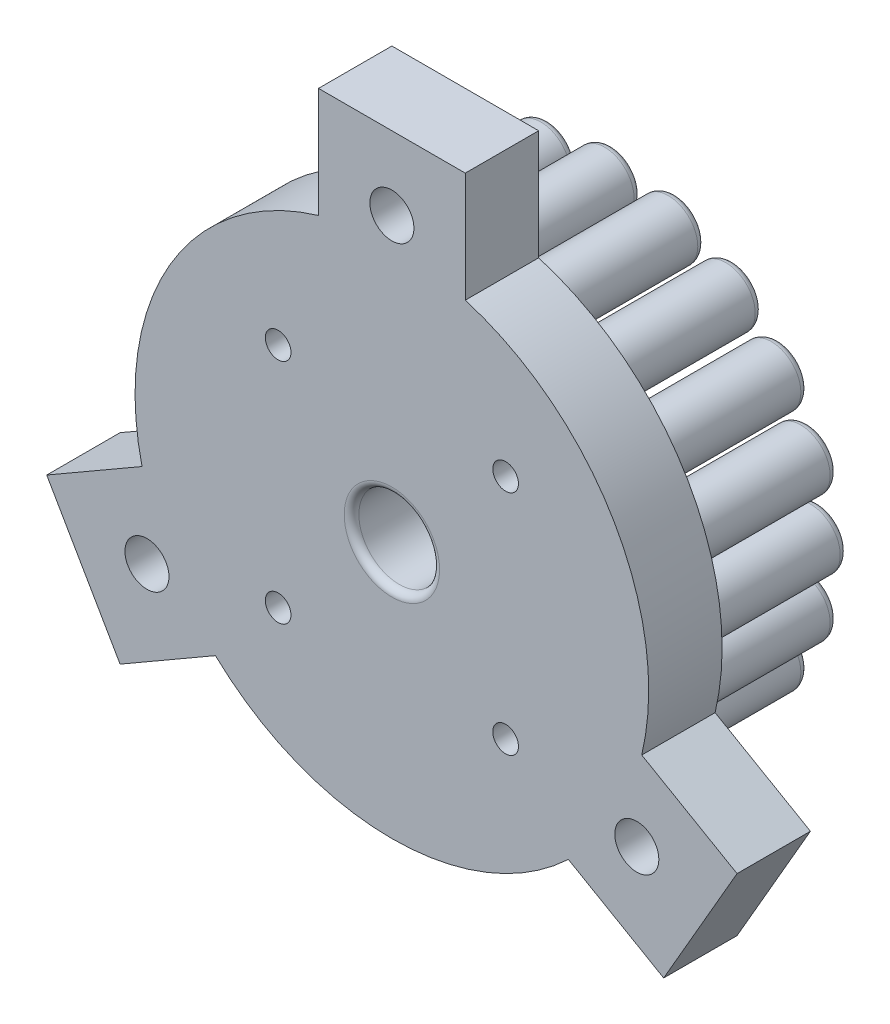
ISO-10303-21;
HEADER;
FILE_DESCRIPTION(('STEP AP214'),'2;1');
FILE_NAME('part.step','',(''),(''),'','','');
FILE_SCHEMA(('AUTOMOTIVE_DESIGN { 1 0 10303 214 1 1 1 1 }'));
ENDSEC;
DATA;
#1=APPLICATION_CONTEXT('core data for automotive mechanical design processes');
#2=APPLICATION_PROTOCOL_DEFINITION('international standard','automotive_design',2000,#1);
#3=PRODUCT_CONTEXT('',#1,'mechanical');
#4=PRODUCT('Part','Part','',(#3));
#5=PRODUCT_RELATED_PRODUCT_CATEGORY('part','',(#4));
#6=PRODUCT_DEFINITION_FORMATION('','',#4);
#7=PRODUCT_DEFINITION_CONTEXT('part definition',#1,'design');
#8=PRODUCT_DEFINITION('design','',#6,#7);
#9=PRODUCT_DEFINITION_SHAPE('','',#8);
#10=(LENGTH_UNIT() NAMED_UNIT(*) SI_UNIT(.MILLI.,.METRE.));
#11=(NAMED_UNIT(*) PLANE_ANGLE_UNIT() SI_UNIT($,.RADIAN.));
#12=(NAMED_UNIT(*) SI_UNIT($,.STERADIAN.) SOLID_ANGLE_UNIT());
#13=UNCERTAINTY_MEASURE_WITH_UNIT(LENGTH_MEASURE(1.E-05),#10,'distance_accuracy_value','');
#14=(GEOMETRIC_REPRESENTATION_CONTEXT(3) GLOBAL_UNCERTAINTY_ASSIGNED_CONTEXT((#13)) GLOBAL_UNIT_ASSIGNED_CONTEXT((#10,
#11,#12)) REPRESENTATION_CONTEXT('',''));
#15=CARTESIAN_POINT('',(0.,0.,0.));
#16=DIRECTION('',(0.,0.,1.));
#17=DIRECTION('',(1.,0.,0.));
#18=AXIS2_PLACEMENT_3D('',#15,#16,#17);
#19=CARTESIAN_POINT('',(15.5,15.5,20.));
#20=DIRECTION('',(0.,0.,1.));
#21=DIRECTION('',(1.,0.,0.));
#22=AXIS2_PLACEMENT_3D('',#19,#20,#21);
#23=CYLINDRICAL_SURFACE('',#22,1.75);
#24=CARTESIAN_POINT('',(15.5,15.5,30.));
#25=DIRECTION('',(0.,0.,1.));
#26=DIRECTION('',(1.,0.,0.));
#27=AXIS2_PLACEMENT_3D('',#24,#25,#26);
#28=CIRCLE('',#27,1.75);
#29=CARTESIAN_POINT('',(17.25,15.5,30.));
#30=VERTEX_POINT('',#29);
#31=EDGE_CURVE('E605',#30,#30,#28,.T.);
#32=ORIENTED_EDGE('',*,*,#31,.T.);
#33=EDGE_LOOP('',(#32));
#34=FACE_BOUND('',#33,.T.);
#35=CARTESIAN_POINT('',(15.5,15.5,23.));
#36=DIRECTION('',(0.,0.,-1.));
#37=DIRECTION('',(-1.,0.,0.));
#38=AXIS2_PLACEMENT_3D('',#35,#36,#37);
#39=CIRCLE('',#38,1.75);
#40=CARTESIAN_POINT('',(13.75,15.5,23.));
#41=VERTEX_POINT('',#40);
#42=EDGE_CURVE('E119',#41,#41,#39,.F.);
#43=ORIENTED_EDGE('',*,*,#42,.F.);
#44=EDGE_LOOP('',(#43));
#45=FACE_BOUND('',#44,.T.);
#46=ADVANCED_FACE('F115',(#34,#45),#23,.F.);
#47=CARTESIAN_POINT('',(-15.5,15.5,20.));
#48=DIRECTION('',(0.,0.,1.));
#49=DIRECTION('',(1.,0.,0.));
#50=AXIS2_PLACEMENT_3D('',#47,#48,#49);
#51=CYLINDRICAL_SURFACE('',#50,1.75);
#52=CARTESIAN_POINT('',(-15.5,15.5,30.));
#53=DIRECTION('',(0.,0.,1.));
#54=DIRECTION('',(1.,0.,0.));
#55=AXIS2_PLACEMENT_3D('',#52,#53,#54);
#56=CIRCLE('',#55,1.75);
#57=CARTESIAN_POINT('',(-13.75,15.5,30.));
#58=VERTEX_POINT('',#57);
#59=EDGE_CURVE('E601',#58,#58,#56,.T.);
#60=ORIENTED_EDGE('',*,*,#59,.T.);
#61=EDGE_LOOP('',(#60));
#62=FACE_BOUND('',#61,.T.);
#63=CARTESIAN_POINT('',(-15.5,15.5,23.));
#64=DIRECTION('',(0.,0.,-1.));
#65=DIRECTION('',(-1.,0.,0.));
#66=AXIS2_PLACEMENT_3D('',#63,#64,#65);
#67=CIRCLE('',#66,1.75);
#68=CARTESIAN_POINT('',(-17.25,15.5,23.));
#69=VERTEX_POINT('',#68);
#70=EDGE_CURVE('E583',#69,#69,#67,.F.);
#71=ORIENTED_EDGE('',*,*,#70,.F.);
#72=EDGE_LOOP('',(#71));
#73=FACE_BOUND('',#72,.T.);
#74=ADVANCED_FACE('F760',(#62,#73),#51,.F.);
#75=CARTESIAN_POINT('',(-15.5,-15.5,20.));
#76=DIRECTION('',(0.,0.,1.));
#77=DIRECTION('',(1.,0.,0.));
#78=AXIS2_PLACEMENT_3D('',#75,#76,#77);
#79=CYLINDRICAL_SURFACE('',#78,1.75);
#80=CARTESIAN_POINT('',(-15.5,-15.5,30.));
#81=DIRECTION('',(0.,0.,1.));
#82=DIRECTION('',(1.,0.,0.));
#83=AXIS2_PLACEMENT_3D('',#80,#81,#82);
#84=CIRCLE('',#83,1.75);
#85=CARTESIAN_POINT('',(-13.75,-15.5,30.));
#86=VERTEX_POINT('',#85);
#87=EDGE_CURVE('E595',#86,#86,#84,.T.);
#88=ORIENTED_EDGE('',*,*,#87,.T.);
#89=EDGE_LOOP('',(#88));
#90=FACE_BOUND('',#89,.T.);
#91=CARTESIAN_POINT('',(-15.5,-15.5,23.));
#92=DIRECTION('',(0.,0.,-1.));
#93=DIRECTION('',(-1.,0.,0.));
#94=AXIS2_PLACEMENT_3D('',#91,#92,#93);
#95=CIRCLE('',#94,1.75);
#96=CARTESIAN_POINT('',(-17.25,-15.5,23.));
#97=VERTEX_POINT('',#96);
#98=EDGE_CURVE('E579',#97,#97,#95,.F.);
#99=ORIENTED_EDGE('',*,*,#98,.F.);
#100=EDGE_LOOP('',(#99));
#101=FACE_BOUND('',#100,.T.);
#102=ADVANCED_FACE('F766',(#90,#101),#79,.F.);
#103=CARTESIAN_POINT('',(15.5,-15.5,20.));
#104=DIRECTION('',(0.,0.,1.));
#105=DIRECTION('',(1.,0.,0.));
#106=AXIS2_PLACEMENT_3D('',#103,#104,#105);
#107=CYLINDRICAL_SURFACE('',#106,1.75);
#108=CARTESIAN_POINT('',(15.5,-15.5,30.));
#109=DIRECTION('',(0.,0.,1.));
#110=DIRECTION('',(1.,0.,0.));
#111=AXIS2_PLACEMENT_3D('',#108,#109,#110);
#112=CIRCLE('',#111,1.75);
#113=CARTESIAN_POINT('',(17.25,-15.5,30.));
#114=VERTEX_POINT('',#113);
#115=EDGE_CURVE('E590',#114,#114,#112,.T.);
#116=ORIENTED_EDGE('',*,*,#115,.T.);
#117=EDGE_LOOP('',(#116));
#118=FACE_BOUND('',#117,.T.);
#119=CARTESIAN_POINT('',(15.5,-15.5,23.));
#120=DIRECTION('',(0.,0.,-1.));
#121=DIRECTION('',(-1.,0.,0.));
#122=AXIS2_PLACEMENT_3D('',#119,#120,#121);
#123=CIRCLE('',#122,1.75);
#124=CARTESIAN_POINT('',(13.75,-15.5,23.));
#125=VERTEX_POINT('',#124);
#126=EDGE_CURVE('E575',#125,#125,#123,.F.);
#127=ORIENTED_EDGE('',*,*,#126,.F.);
#128=EDGE_LOOP('',(#127));
#129=FACE_BOUND('',#128,.T.);
#130=ADVANCED_FACE('F771',(#118,#129),#107,.F.);
#131=CARTESIAN_POINT('',(0.,0.,30.));
#132=DIRECTION('',(0.,0.,-1.));
#133=DIRECTION('',(-1.,0.,0.));
#134=AXIS2_PLACEMENT_3D('',#131,#132,#133);
#135=CYLINDRICAL_SURFACE('',#134,35.);
#136=CARTESIAN_POINT('',(0.,0.,30.));
#137=DIRECTION('',(0.,0.,1.));
#138=DIRECTION('',(1.,0.,0.));
#139=AXIS2_PLACEMENT_3D('',#136,#137,#138);
#140=CIRCLE('',#139,35.);
#141=CARTESIAN_POINT('',(-24.0473750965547,-25.4307638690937,30.));
#142=VERTEX_POINT('',#141);
#143=CARTESIAN_POINT('',(24.0473750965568,-25.4307638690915,30.));
#144=VERTEX_POINT('',#143);
#145=EDGE_CURVE('E318',#142,#144,#140,.T.);
#146=ORIENTED_EDGE('',*,*,#145,.F.);
#147=DIRECTION('',(0.,0.,1.));
#148=VECTOR('',#147,1.);
#149=CARTESIAN_POINT('',(-24.0473750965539,-25.4307638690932,20.));
#150=LINE('',#149,#148);
#151=CARTESIAN_POINT('',(-24.0473750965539,-25.4307638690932,20.));
#152=VERTEX_POINT('',#151);
#153=EDGE_CURVE('E218',#152,#142,#150,.T.);
#154=ORIENTED_EDGE('',*,*,#153,.F.);
#155=CARTESIAN_POINT('',(0.,0.,20.));
#156=DIRECTION('',(0.,0.,1.));
#157=DIRECTION('',(1.,0.,0.));
#158=AXIS2_PLACEMENT_3D('',#155,#156,#157);
#159=CIRCLE('',#158,35.);
#160=CARTESIAN_POINT('',(24.0473750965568,-25.4307638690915,20.));
#161=VERTEX_POINT('',#160);
#162=EDGE_CURVE('E324',#152,#161,#159,.T.);
#163=ORIENTED_EDGE('',*,*,#162,.T.);
#164=DIRECTION('',(0.,0.,1.));
#165=VECTOR('',#164,1.);
#166=CARTESIAN_POINT('',(24.0473750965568,-25.4307638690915,20.));
#167=LINE('',#166,#165);
#168=EDGE_CURVE('E245',#161,#144,#167,.T.);
#169=ORIENTED_EDGE('',*,*,#168,.T.);
#170=EDGE_LOOP('',(#146,#154,#163,#169));
#171=FACE_BOUND('',#170,.T.);
#172=ADVANCED_FACE('F646',(#171),#135,.T.);
#173=CARTESIAN_POINT('',(34.0473750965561,-8.11025579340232,30.));
#174=VERTEX_POINT('',#173);
#175=CARTESIAN_POINT('',(10.,33.5410196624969,30.));
#176=VERTEX_POINT('',#175);
#177=EDGE_CURVE('E319',#174,#176,#140,.T.);
#178=ORIENTED_EDGE('',*,*,#177,.F.);
#179=DIRECTION('',(0.,0.,1.));
#180=VECTOR('',#179,1.);
#181=CARTESIAN_POINT('',(34.0473750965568,-8.11025579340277,20.));
#182=LINE('',#181,#180);
#183=CARTESIAN_POINT('',(34.0473750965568,-8.11025579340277,20.));
#184=VERTEX_POINT('',#183);
#185=EDGE_CURVE('E238',#184,#174,#182,.T.);
#186=ORIENTED_EDGE('',*,*,#185,.F.);
#187=CARTESIAN_POINT('',(10.,33.5410196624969,20.));
#188=VERTEX_POINT('',#187);
#189=EDGE_CURVE('E303',#184,#188,#159,.T.);
#190=ORIENTED_EDGE('',*,*,#189,.T.);
#191=DIRECTION('',(0.,0.,1.));
#192=VECTOR('',#191,1.);
#193=CARTESIAN_POINT('',(10.,33.5410196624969,20.));
#194=LINE('',#193,#192);
#195=EDGE_CURVE('E307',#188,#176,#194,.T.);
#196=ORIENTED_EDGE('',*,*,#195,.T.);
#197=EDGE_LOOP('',(#178,#186,#190,#196));
#198=FACE_BOUND('',#197,.T.);
#199=ADVANCED_FACE('F746',(#198),#135,.T.);
#200=CARTESIAN_POINT('',(26.7246881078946,8.68337754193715,20.));
#201=DIRECTION('',(0.,0.,-1.));
#202=DIRECTION('',(-1.,0.,0.));
#203=AXIS2_PLACEMENT_3D('',#200,#201,#202);
#204=CYLINDRICAL_SURFACE('',#203,4.00000000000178);
#205=CARTESIAN_POINT('',(26.7246881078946,8.68337754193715,1.));
#206=DIRECTION('',(0.,0.,1.));
#207=DIRECTION('',(1.,0.,0.));
#208=AXIS2_PLACEMENT_3D('',#205,#206,#207);
#209=CIRCLE('',#208,4.00000000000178);
#210=CARTESIAN_POINT('',(30.7246881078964,8.68337754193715,1.));
#211=VERTEX_POINT('',#210);
#212=EDGE_CURVE('E420',#211,#211,#209,.T.);
#213=ORIENTED_EDGE('',*,*,#212,.T.);
#214=EDGE_LOOP('',(#213));
#215=FACE_BOUND('',#214,.T.);
#216=CARTESIAN_POINT('',(26.7246881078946,8.68337754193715,20.));
#217=DIRECTION('',(0.,0.,1.));
#218=DIRECTION('',(1.,0.,0.));
#219=AXIS2_PLACEMENT_3D('',#216,#217,#218);
#220=CIRCLE('',#219,4.00000000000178);
#221=CARTESIAN_POINT('',(30.7246881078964,8.68337754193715,20.));
#222=VERTEX_POINT('',#221);
#223=EDGE_CURVE('E317',#222,#222,#220,.T.);
#224=ORIENTED_EDGE('',*,*,#223,.F.);
#225=EDGE_LOOP('',(#224));
#226=FACE_BOUND('',#225,.T.);
#227=ADVANCED_FACE('F743',(#215,#226),#204,.T.);
#228=CARTESIAN_POINT('',(26.7246881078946,8.68337754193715,0.));
#229=DIRECTION('',(0.,0.,1.));
#230=DIRECTION('',(1.,0.,0.));
#231=AXIS2_PLACEMENT_3D('',#228,#229,#230);
#232=PLANE('',#231);
#233=CARTESIAN_POINT('',(26.7246881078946,8.68337754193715,0.));
#234=DIRECTION('',(0.,0.,1.));
#235=DIRECTION('',(1.,0.,0.));
#236=AXIS2_PLACEMENT_3D('',#233,#234,#235);
#237=CIRCLE('',#236,3.00000000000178);
#238=CARTESIAN_POINT('',(29.7246881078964,8.68337754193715,0.));
#239=VERTEX_POINT('',#238);
#240=EDGE_CURVE('E424',#239,#239,#237,.F.);
#241=ORIENTED_EDGE('',*,*,#240,.T.);
#242=EDGE_LOOP('',(#241));
#243=FACE_BOUND('',#242,.T.);
#244=ADVANCED_FACE('F745',(#243),#232,.F.);
#245=CARTESIAN_POINT('',(-10.,33.5410196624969,20.));
#246=VERTEX_POINT('',#245);
#247=CARTESIAN_POINT('',(-34.0473750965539,-8.11025579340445,20.));
#248=VERTEX_POINT('',#247);
#249=EDGE_CURVE('E320',#246,#248,#159,.T.);
#250=ORIENTED_EDGE('',*,*,#249,.T.);
#251=DIRECTION('',(0.,0.,1.));
#252=VECTOR('',#251,1.);
#253=CARTESIAN_POINT('',(-34.0473750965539,-8.11025579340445,20.));
#254=LINE('',#253,#252);
#255=CARTESIAN_POINT('',(-34.0473750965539,-8.11025579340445,30.));
#256=VERTEX_POINT('',#255);
#257=EDGE_CURVE('E242',#248,#256,#254,.T.);
#258=ORIENTED_EDGE('',*,*,#257,.T.);
#259=CARTESIAN_POINT('',(-10.,33.5410196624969,30.));
#260=VERTEX_POINT('',#259);
#261=EDGE_CURVE('E314',#260,#256,#140,.T.);
#262=ORIENTED_EDGE('',*,*,#261,.F.);
#263=DIRECTION('',(0.,0.,1.));
#264=VECTOR('',#263,1.);
#265=CARTESIAN_POINT('',(-10.,33.5410196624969,20.));
#266=LINE('',#265,#264);
#267=EDGE_CURVE('E290',#246,#260,#266,.T.);
#268=ORIENTED_EDGE('',*,*,#267,.F.);
#269=EDGE_LOOP('',(#250,#258,#262,#268));
#270=FACE_BOUND('',#269,.T.);
#271=ADVANCED_FACE('F753',(#270),#135,.T.);
#272=CARTESIAN_POINT('',(0.,0.,30.));
#273=DIRECTION('',(0.,0.,1.));
#274=DIRECTION('',(1.,0.,0.));
#275=AXIS2_PLACEMENT_3D('',#272,#273,#274);
#276=PLANE('',#275);
#277=ORIENTED_EDGE('',*,*,#115,.F.);
#278=EDGE_LOOP('',(#277));
#279=FACE_BOUND('',#278,.T.);
#280=ORIENTED_EDGE('',*,*,#87,.F.);
#281=EDGE_LOOP('',(#280));
#282=FACE_BOUND('',#281,.T.);
#283=ORIENTED_EDGE('',*,*,#59,.F.);
#284=EDGE_LOOP('',(#283));
#285=FACE_BOUND('',#284,.T.);
#286=ORIENTED_EDGE('',*,*,#31,.F.);
#287=EDGE_LOOP('',(#286));
#288=FACE_BOUND('',#287,.T.);
#289=CARTESIAN_POINT('',(0.,0.,30.));
#290=DIRECTION('',(0.,0.,1.));
#291=DIRECTION('',(1.,0.,0.));
#292=AXIS2_PLACEMENT_3D('',#289,#290,#291);
#293=CIRCLE('',#292,6.5);
#294=CARTESIAN_POINT('',(6.5,0.,30.));
#295=VERTEX_POINT('',#294);
#296=EDGE_CURVE('E412',#295,#295,#293,.F.);
#297=ORIENTED_EDGE('',*,*,#296,.T.);
#298=EDGE_LOOP('',(#297));
#299=FACE_BOUND('',#298,.T.);
#300=CARTESIAN_POINT('',(0.,38.5410196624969,30.));
#301=DIRECTION('',(0.,0.,1.));
#302=DIRECTION('',(1.,0.,0.));
#303=AXIS2_PLACEMENT_3D('',#300,#301,#302);
#304=CIRCLE('',#303,3.);
#305=CARTESIAN_POINT('',(3.,38.5410196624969,30.));
#306=VERTEX_POINT('',#305);
#307=EDGE_CURVE('E610',#306,#306,#304,.T.);
#308=ORIENTED_EDGE('',*,*,#307,.F.);
#309=EDGE_LOOP('',(#308));
#310=FACE_BOUND('',#309,.T.);
#311=CARTESIAN_POINT('',(33.3775021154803,-19.270509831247,30.));
#312=DIRECTION('',(0.,0.,1.));
#313=DIRECTION('',(1.,0.,0.));
#314=AXIS2_PLACEMENT_3D('',#311,#312,#313);
#315=CIRCLE('',#314,3.00000000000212);
#316=CARTESIAN_POINT('',(36.3775021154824,-19.270509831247,30.));
#317=VERTEX_POINT('',#316);
#318=EDGE_CURVE('E615',#317,#317,#315,.T.);
#319=ORIENTED_EDGE('',*,*,#318,.F.);
#320=EDGE_LOOP('',(#319));
#321=FACE_BOUND('',#320,.T.);
#322=CARTESIAN_POINT('',(-33.3775021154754,-19.2705098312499,30.));
#323=DIRECTION('',(0.,0.,1.));
#324=DIRECTION('',(1.,0.,0.));
#325=AXIS2_PLACEMENT_3D('',#322,#323,#324);
#326=CIRCLE('',#325,3.00000000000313);
#327=CARTESIAN_POINT('',(-30.3775021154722,-19.2705098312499,30.));
#328=VERTEX_POINT('',#327);
#329=EDGE_CURVE('E623',#328,#328,#326,.T.);
#330=ORIENTED_EDGE('',*,*,#329,.F.);
#331=EDGE_LOOP('',(#330));
#332=FACE_BOUND('',#331,.T.);
#333=ORIENTED_EDGE('',*,*,#261,.T.);
#334=DIRECTION('',(-0.866025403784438,-0.5,0.));
#335=VECTOR('',#334,1.);
#336=CARTESIAN_POINT('',(-34.0473750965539,-8.11025579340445,30.));
#337=LINE('',#336,#335);
#338=CARTESIAN_POINT('',(-47.0377561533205,-15.6102557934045,30.));
#339=VERTEX_POINT('',#338);
#340=EDGE_CURVE('E222',#256,#339,#337,.T.);
#341=ORIENTED_EDGE('',*,*,#340,.T.);
#342=DIRECTION('',(0.5,-0.866025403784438,0.));
#343=VECTOR('',#342,1.);
#344=CARTESIAN_POINT('',(-37.0377561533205,-32.9307638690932,30.));
#345=LINE('',#344,#343);
#346=CARTESIAN_POINT('',(-37.0377561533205,-32.9307638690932,30.));
#347=VERTEX_POINT('',#346);
#348=EDGE_CURVE('E210',#339,#347,#345,.T.);
#349=ORIENTED_EDGE('',*,*,#348,.T.);
#350=DIRECTION('',(0.866025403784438,0.5,0.));
#351=VECTOR('',#350,1.);
#352=CARTESIAN_POINT('',(-24.0473750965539,-25.4307638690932,30.));
#353=LINE('',#352,#351);
#354=EDGE_CURVE('E133',#347,#142,#353,.T.);
#355=ORIENTED_EDGE('',*,*,#354,.T.);
#356=ORIENTED_EDGE('',*,*,#145,.T.);
#357=DIRECTION('',(0.866025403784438,-0.5,0.));
#358=VECTOR('',#357,1.);
#359=CARTESIAN_POINT('',(24.0473750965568,-25.4307638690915,30.));
#360=LINE('',#359,#358);
#361=CARTESIAN_POINT('',(37.0377561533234,-32.9307638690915,30.));
#362=VERTEX_POINT('',#361);
#363=EDGE_CURVE('E264',#144,#362,#360,.T.);
#364=ORIENTED_EDGE('',*,*,#363,.T.);
#365=DIRECTION('',(0.5,0.866025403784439,0.));
#366=VECTOR('',#365,1.);
#367=CARTESIAN_POINT('',(47.0377561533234,-15.6102557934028,30.));
#368=LINE('',#367,#366);
#369=CARTESIAN_POINT('',(47.0377561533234,-15.6102557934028,30.));
#370=VERTEX_POINT('',#369);
#371=EDGE_CURVE('E260',#362,#370,#368,.T.);
#372=ORIENTED_EDGE('',*,*,#371,.T.);
#373=DIRECTION('',(-0.866025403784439,0.5,0.));
#374=VECTOR('',#373,1.);
#375=CARTESIAN_POINT('',(34.0473750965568,-8.11025579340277,30.));
#376=LINE('',#375,#374);
#377=EDGE_CURVE('E140',#370,#174,#376,.T.);
#378=ORIENTED_EDGE('',*,*,#377,.T.);
#379=ORIENTED_EDGE('',*,*,#177,.T.);
#380=DIRECTION('',(0.,1.,0.));
#381=VECTOR('',#380,1.);
#382=CARTESIAN_POINT('',(10.,33.5410196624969,30.));
#383=LINE('',#382,#381);
#384=CARTESIAN_POINT('',(10.,48.5410196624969,30.));
#385=VERTEX_POINT('',#384);
#386=EDGE_CURVE('E293',#176,#385,#383,.T.);
#387=ORIENTED_EDGE('',*,*,#386,.T.);
#388=DIRECTION('',(-1.,0.,0.));
#389=VECTOR('',#388,1.);
#390=CARTESIAN_POINT('',(-10.,48.5410196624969,30.));
#391=LINE('',#390,#389);
#392=CARTESIAN_POINT('',(-10.,48.5410196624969,30.));
#393=VERTEX_POINT('',#392);
#394=EDGE_CURVE('E282',#385,#393,#391,.T.);
#395=ORIENTED_EDGE('',*,*,#394,.T.);
#396=DIRECTION('',(0.,-1.,0.));
#397=VECTOR('',#396,1.);
#398=CARTESIAN_POINT('',(-10.,33.5410196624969,30.));
#399=LINE('',#398,#397);
#400=EDGE_CURVE('E268',#393,#260,#399,.T.);
#401=ORIENTED_EDGE('',*,*,#400,.T.);
#402=EDGE_LOOP('',(#333,#341,#349,#355,#356,#364,#372,#378,#379,#387,#395,#401));
#403=FACE_BOUND('',#402,.T.);
#404=ADVANCED_FACE('F221',(#279,#282,#285,#288,#299,#310,#321,#332,#403),#276,.T.);
#405=CARTESIAN_POINT('',(0.,0.,20.));
#406=DIRECTION('',(0.,0.,1.));
#407=DIRECTION('',(1.,0.,0.));
#408=AXIS2_PLACEMENT_3D('',#405,#406,#407);
#409=PLANE('',#408);
#410=CARTESIAN_POINT('',(-15.5,15.5,20.));
#411=DIRECTION('',(0.,0.,-1.));
#412=DIRECTION('',(-1.,0.,0.));
#413=AXIS2_PLACEMENT_3D('',#410,#411,#412);
#414=CIRCLE('',#413,3.3);
#415=CARTESIAN_POINT('',(-18.8,15.5,20.));
#416=VERTEX_POINT('',#415);
#417=EDGE_CURVE('E658',#416,#416,#414,.T.);
#418=ORIENTED_EDGE('',*,*,#417,.F.);
#419=EDGE_LOOP('',(#418));
#420=FACE_BOUND('',#419,.T.);
#421=CARTESIAN_POINT('',(15.5,-15.5,20.));
#422=DIRECTION('',(0.,0.,-1.));
#423=DIRECTION('',(-1.,0.,0.));
#424=AXIS2_PLACEMENT_3D('',#421,#422,#423);
#425=CIRCLE('',#424,3.3);
#426=CARTESIAN_POINT('',(12.2,-15.5,20.));
#427=VERTEX_POINT('',#426);
#428=EDGE_CURVE('E666',#427,#427,#425,.T.);
#429=ORIENTED_EDGE('',*,*,#428,.F.);
#430=EDGE_LOOP('',(#429));
#431=FACE_BOUND('',#430,.T.);
#432=CARTESIAN_POINT('',(-15.5,-15.5,20.));
#433=DIRECTION('',(0.,0.,-1.));
#434=DIRECTION('',(-1.,0.,0.));
#435=AXIS2_PLACEMENT_3D('',#432,#433,#434);
#436=CIRCLE('',#435,3.3);
#437=CARTESIAN_POINT('',(-18.8,-15.5,20.));
#438=VERTEX_POINT('',#437);
#439=EDGE_CURVE('E667',#438,#438,#436,.T.);
#440=ORIENTED_EDGE('',*,*,#439,.F.);
#441=EDGE_LOOP('',(#440));
#442=FACE_BOUND('',#441,.T.);
#443=CARTESIAN_POINT('',(15.5,15.5,20.));
#444=DIRECTION('',(0.,0.,-1.));
#445=DIRECTION('',(-1.,0.,0.));
#446=AXIS2_PLACEMENT_3D('',#443,#444,#445);
#447=CIRCLE('',#446,3.3);
#448=CARTESIAN_POINT('',(12.2,15.5,20.));
#449=VERTEX_POINT('',#448);
#450=EDGE_CURVE('E654',#449,#449,#447,.T.);
#451=ORIENTED_EDGE('',*,*,#450,.F.);
#452=EDGE_LOOP('',(#451));
#453=FACE_BOUND('',#452,.T.);
#454=CARTESIAN_POINT('',(0.,0.,20.));
#455=DIRECTION('',(0.,0.,1.));
#456=DIRECTION('',(1.,0.,0.));
#457=AXIS2_PLACEMENT_3D('',#454,#455,#456);
#458=CIRCLE('',#457,6.5);
#459=CARTESIAN_POINT('',(6.5,0.,20.));
#460=VERTEX_POINT('',#459);
#461=EDGE_CURVE('E416',#460,#460,#458,.T.);
#462=ORIENTED_EDGE('',*,*,#461,.T.);
#463=EDGE_LOOP('',(#462));
#464=FACE_BOUND('',#463,.T.);
#465=CARTESIAN_POINT('',(0.,38.5410196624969,20.));
#466=DIRECTION('',(0.,0.,1.));
#467=DIRECTION('',(1.,0.,0.));
#468=AXIS2_PLACEMENT_3D('',#465,#466,#467);
#469=CIRCLE('',#468,3.);
#470=CARTESIAN_POINT('',(3.,38.5410196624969,20.));
#471=VERTEX_POINT('',#470);
#472=EDGE_CURVE('E614',#471,#471,#469,.F.);
#473=ORIENTED_EDGE('',*,*,#472,.F.);
#474=EDGE_LOOP('',(#473));
#475=FACE_BOUND('',#474,.T.);
#476=CARTESIAN_POINT('',(33.3775021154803,-19.270509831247,20.));
#477=DIRECTION('',(0.,0.,1.));
#478=DIRECTION('',(1.,0.,0.));
#479=AXIS2_PLACEMENT_3D('',#476,#477,#478);
#480=CIRCLE('',#479,3.00000000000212);
#481=CARTESIAN_POINT('',(36.3775021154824,-19.270509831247,20.));
#482=VERTEX_POINT('',#481);
#483=EDGE_CURVE('E619',#482,#482,#480,.F.);
#484=ORIENTED_EDGE('',*,*,#483,.F.);
#485=EDGE_LOOP('',(#484));
#486=FACE_BOUND('',#485,.T.);
#487=CARTESIAN_POINT('',(-33.3775021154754,-19.2705098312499,20.));
#488=DIRECTION('',(0.,0.,1.));
#489=DIRECTION('',(1.,0.,0.));
#490=AXIS2_PLACEMENT_3D('',#487,#488,#489);
#491=CIRCLE('',#490,3.00000000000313);
#492=CARTESIAN_POINT('',(-30.3775021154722,-19.2705098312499,20.));
#493=VERTEX_POINT('',#492);
#494=EDGE_CURVE('E609',#493,#493,#491,.F.);
#495=ORIENTED_EDGE('',*,*,#494,.F.);
#496=EDGE_LOOP('',(#495));
#497=FACE_BOUND('',#496,.T.);
#498=CARTESIAN_POINT('',(-8.68337754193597,26.7246881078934,20.));
#499=DIRECTION('',(0.,0.,1.));
#500=DIRECTION('',(1.,0.,0.));
#501=AXIS2_PLACEMENT_3D('',#498,#499,#500);
#502=CIRCLE('',#501,4.00000000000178);
#503=CARTESIAN_POINT('',(-4.68337754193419,26.7246881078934,20.));
#504=VERTEX_POINT('',#503);
#505=EDGE_CURVE('E400',#504,#504,#502,.F.);
#506=ORIENTED_EDGE('',*,*,#505,.F.);
#507=EDGE_LOOP('',(#506));
#508=FACE_BOUND('',#507,.T.);
#509=CARTESIAN_POINT('',(-16.5167655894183,22.7333775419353,20.));
#510=DIRECTION('',(0.,0.,1.));
#511=DIRECTION('',(1.,0.,0.));
#512=AXIS2_PLACEMENT_3D('',#509,#510,#511);
#513=CIRCLE('',#512,4.00000000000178);
#514=CARTESIAN_POINT('',(-12.5167655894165,22.7333775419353,20.));
#515=VERTEX_POINT('',#514);
#516=EDGE_CURVE('E396',#515,#515,#513,.F.);
#517=ORIENTED_EDGE('',*,*,#516,.F.);
#518=EDGE_LOOP('',(#517));
#519=FACE_BOUND('',#518,.T.);
#520=CARTESIAN_POINT('',(-22.7333775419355,16.5167655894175,20.));
#521=DIRECTION('',(0.,0.,1.));
#522=DIRECTION('',(1.,0.,0.));
#523=AXIS2_PLACEMENT_3D('',#520,#521,#522);
#524=CIRCLE('',#523,4.00000000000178);
#525=CARTESIAN_POINT('',(-18.7333775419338,16.5167655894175,20.));
#526=VERTEX_POINT('',#525);
#527=EDGE_CURVE('E392',#526,#526,#524,.F.);
#528=ORIENTED_EDGE('',*,*,#527,.F.);
#529=EDGE_LOOP('',(#528));
#530=FACE_BOUND('',#529,.T.);
#531=CARTESIAN_POINT('',(-26.724688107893,8.68337754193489,20.));
#532=DIRECTION('',(0.,0.,1.));
#533=DIRECTION('',(1.,0.,0.));
#534=AXIS2_PLACEMENT_3D('',#531,#532,#533);
#535=CIRCLE('',#534,4.00000000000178);
#536=CARTESIAN_POINT('',(-22.7246881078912,8.68337754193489,20.));
#537=VERTEX_POINT('',#536);
#538=EDGE_CURVE('E388',#537,#537,#535,.F.);
#539=ORIENTED_EDGE('',*,*,#538,.F.);
#540=EDGE_LOOP('',(#539));
#541=FACE_BOUND('',#540,.T.);
#542=CARTESIAN_POINT('',(-28.0999999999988,-1.19201566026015E-12,20.));
#543=DIRECTION('',(0.,0.,1.));
#544=DIRECTION('',(1.,0.,0.));
#545=AXIS2_PLACEMENT_3D('',#542,#543,#544);
#546=CIRCLE('',#545,4.00000000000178);
#547=CARTESIAN_POINT('',(-24.099999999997,-1.19201566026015E-12,20.));
#548=VERTEX_POINT('',#547);
#549=EDGE_CURVE('E384',#548,#548,#546,.F.);
#550=ORIENTED_EDGE('',*,*,#549,.F.);
#551=EDGE_LOOP('',(#550));
#552=FACE_BOUND('',#551,.T.);
#553=CARTESIAN_POINT('',(-26.7246881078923,-8.68337754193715,20.));
#554=DIRECTION('',(0.,0.,1.));
#555=DIRECTION('',(1.,0.,0.));
#556=AXIS2_PLACEMENT_3D('',#553,#554,#555);
#557=CIRCLE('',#556,4.00000000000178);
#558=CARTESIAN_POINT('',(-22.7246881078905,-8.68337754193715,20.));
#559=VERTEX_POINT('',#558);
#560=EDGE_CURVE('E380',#559,#559,#557,.F.);
#561=ORIENTED_EDGE('',*,*,#560,.F.);
#562=EDGE_LOOP('',(#561));
#563=FACE_BOUND('',#562,.T.);
#564=CARTESIAN_POINT('',(-22.7333775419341,-16.5167655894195,20.));
#565=DIRECTION('',(0.,0.,1.));
#566=DIRECTION('',(1.,0.,0.));
#567=AXIS2_PLACEMENT_3D('',#564,#565,#566);
#568=CIRCLE('',#567,4.00000000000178);
#569=CARTESIAN_POINT('',(-18.7333775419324,-16.5167655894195,20.));
#570=VERTEX_POINT('',#569);
#571=EDGE_CURVE('E376',#570,#570,#568,.F.);
#572=ORIENTED_EDGE('',*,*,#571,.F.);
#573=EDGE_LOOP('',(#572));
#574=FACE_BOUND('',#573,.T.);
#575=CARTESIAN_POINT('',(28.1000000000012,1.18857440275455E-12,20.));
#576=DIRECTION('',(0.,0.,1.));
#577=DIRECTION('',(1.,0.,0.));
#578=AXIS2_PLACEMENT_3D('',#575,#576,#577);
#579=CIRCLE('',#578,4.00000000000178);
#580=CARTESIAN_POINT('',(32.100000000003,1.18857440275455E-12,20.));
#581=VERTEX_POINT('',#580);
#582=EDGE_CURVE('E372',#581,#581,#579,.F.);
#583=ORIENTED_EDGE('',*,*,#582,.F.);
#584=EDGE_LOOP('',(#583));
#585=FACE_BOUND('',#584,.T.);
#586=CARTESIAN_POINT('',(26.7246881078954,-8.68337754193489,20.));
#587=DIRECTION('',(0.,0.,1.));
#588=DIRECTION('',(1.,0.,0.));
#589=AXIS2_PLACEMENT_3D('',#586,#587,#588);
#590=CIRCLE('',#589,4.00000000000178);
#591=CARTESIAN_POINT('',(30.7246881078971,-8.68337754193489,20.));
#592=VERTEX_POINT('',#591);
#593=EDGE_CURVE('E368',#592,#592,#590,.F.);
#594=ORIENTED_EDGE('',*,*,#593,.F.);
#595=EDGE_LOOP('',(#594));
#596=FACE_BOUND('',#595,.T.);
#597=CARTESIAN_POINT('',(22.7333775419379,-16.5167655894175,20.));
#598=DIRECTION('',(0.,0.,1.));
#599=DIRECTION('',(1.,0.,0.));
#600=AXIS2_PLACEMENT_3D('',#597,#598,#599);
#601=CIRCLE('',#600,4.00000000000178);
#602=CARTESIAN_POINT('',(26.7333775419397,-16.5167655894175,20.));
#603=VERTEX_POINT('',#602);
#604=EDGE_CURVE('E364',#603,#603,#601,.F.);
#605=ORIENTED_EDGE('',*,*,#604,.F.);
#606=EDGE_LOOP('',(#605));
#607=FACE_BOUND('',#606,.T.);
#608=CARTESIAN_POINT('',(16.5167655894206,-22.7333775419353,20.));
#609=DIRECTION('',(0.,0.,1.));
#610=DIRECTION('',(1.,0.,0.));
#611=AXIS2_PLACEMENT_3D('',#608,#609,#610);
#612=CIRCLE('',#611,4.00000000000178);
#613=CARTESIAN_POINT('',(20.5167655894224,-22.7333775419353,20.));
#614=VERTEX_POINT('',#613);
#615=EDGE_CURVE('E360',#614,#614,#612,.F.);
#616=ORIENTED_EDGE('',*,*,#615,.F.);
#617=EDGE_LOOP('',(#616));
#618=FACE_BOUND('',#617,.T.);
#619=CARTESIAN_POINT('',(8.68337754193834,-26.7246881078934,20.));
#620=DIRECTION('',(0.,0.,1.));
#621=DIRECTION('',(1.,0.,0.));
#622=AXIS2_PLACEMENT_3D('',#619,#620,#621);
#623=CIRCLE('',#622,4.00000000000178);
#624=CARTESIAN_POINT('',(12.6833775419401,-26.7246881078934,20.));
#625=VERTEX_POINT('',#624);
#626=EDGE_CURVE('E356',#625,#625,#623,.F.);
#627=ORIENTED_EDGE('',*,*,#626,.F.);
#628=EDGE_LOOP('',(#627));
#629=FACE_BOUND('',#628,.T.);
#630=CARTESIAN_POINT('',(2.37714880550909E-12,-28.1,20.));
#631=DIRECTION('',(0.,0.,1.));
#632=DIRECTION('',(1.,0.,0.));
#633=AXIS2_PLACEMENT_3D('',#630,#631,#632);
#634=CIRCLE('',#633,4.00000000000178);
#635=CARTESIAN_POINT('',(4.00000000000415,-28.1,20.));
#636=VERTEX_POINT('',#635);
#637=EDGE_CURVE('E352',#636,#636,#634,.F.);
#638=ORIENTED_EDGE('',*,*,#637,.F.);
#639=EDGE_LOOP('',(#638));
#640=FACE_BOUND('',#639,.T.);
#641=CARTESIAN_POINT('',(-8.6833775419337,-26.7246881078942,20.));
#642=DIRECTION('',(0.,0.,1.));
#643=DIRECTION('',(1.,0.,0.));
#644=AXIS2_PLACEMENT_3D('',#641,#642,#643);
#645=CIRCLE('',#644,4.00000000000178);
#646=CARTESIAN_POINT('',(-4.68337754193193,-26.7246881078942,20.));
#647=VERTEX_POINT('',#646);
#648=EDGE_CURVE('E348',#647,#647,#645,.F.);
#649=ORIENTED_EDGE('',*,*,#648,.F.);
#650=EDGE_LOOP('',(#649));
#651=FACE_BOUND('',#650,.T.);
#652=CARTESIAN_POINT('',(-16.5167655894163,-22.7333775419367,20.));
#653=DIRECTION('',(0.,0.,1.));
#654=DIRECTION('',(1.,0.,0.));
#655=AXIS2_PLACEMENT_3D('',#652,#653,#654);
#656=CIRCLE('',#655,4.00000000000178);
#657=CARTESIAN_POINT('',(-12.5167655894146,-22.7333775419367,20.));
#658=VERTEX_POINT('',#657);
#659=EDGE_CURVE('E344',#658,#658,#656,.F.);
#660=ORIENTED_EDGE('',*,*,#659,.F.);
#661=EDGE_LOOP('',(#660));
#662=FACE_BOUND('',#661,.T.);
#663=CARTESIAN_POINT('',(0.,28.1,20.));
#664=DIRECTION('',(0.,0.,1.));
#665=DIRECTION('',(1.,0.,0.));
#666=AXIS2_PLACEMENT_3D('',#663,#664,#665);
#667=CIRCLE('',#666,4.00000000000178);
#668=CARTESIAN_POINT('',(4.00000000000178,28.1,20.));
#669=VERTEX_POINT('',#668);
#670=EDGE_CURVE('E340',#669,#669,#667,.F.);
#671=ORIENTED_EDGE('',*,*,#670,.F.);
#672=EDGE_LOOP('',(#671));
#673=FACE_BOUND('',#672,.T.);
#674=CARTESIAN_POINT('',(8.68337754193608,26.7246881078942,20.));
#675=DIRECTION('',(0.,0.,1.));
#676=DIRECTION('',(1.,0.,0.));
#677=AXIS2_PLACEMENT_3D('',#674,#675,#676);
#678=CIRCLE('',#677,4.00000000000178);
#679=CARTESIAN_POINT('',(12.6833775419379,26.7246881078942,20.));
#680=VERTEX_POINT('',#679);
#681=EDGE_CURVE('E336',#680,#680,#678,.F.);
#682=ORIENTED_EDGE('',*,*,#681,.F.);
#683=EDGE_LOOP('',(#682));
#684=FACE_BOUND('',#683,.T.);
#685=CARTESIAN_POINT('',(16.5167655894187,22.7333775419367,20.));
#686=DIRECTION('',(0.,0.,1.));
#687=DIRECTION('',(1.,0.,0.));
#688=AXIS2_PLACEMENT_3D('',#685,#686,#687);
#689=CIRCLE('',#688,4.00000000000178);
#690=CARTESIAN_POINT('',(20.5167655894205,22.7333775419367,20.));
#691=VERTEX_POINT('',#690);
#692=EDGE_CURVE('E332',#691,#691,#689,.F.);
#693=ORIENTED_EDGE('',*,*,#692,.F.);
#694=EDGE_LOOP('',(#693));
#695=FACE_BOUND('',#694,.T.);
#696=CARTESIAN_POINT('',(22.7333775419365,16.5167655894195,20.));
#697=DIRECTION('',(0.,0.,1.));
#698=DIRECTION('',(1.,0.,0.));
#699=AXIS2_PLACEMENT_3D('',#696,#697,#698);
#700=CIRCLE('',#699,4.00000000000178);
#701=CARTESIAN_POINT('',(26.7333775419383,16.5167655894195,20.));
#702=VERTEX_POINT('',#701);
#703=EDGE_CURVE('E328',#702,#702,#700,.F.);
#704=ORIENTED_EDGE('',*,*,#703,.F.);
#705=EDGE_LOOP('',(#704));
#706=FACE_BOUND('',#705,.T.);
#707=ORIENTED_EDGE('',*,*,#223,.T.);
#708=EDGE_LOOP('',(#707));
#709=FACE_BOUND('',#708,.T.);
#710=ORIENTED_EDGE('',*,*,#162,.F.);
#711=DIRECTION('',(0.866025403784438,0.5,0.));
#712=VECTOR('',#711,1.);
#713=CARTESIAN_POINT('',(-24.0473750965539,-25.4307638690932,20.));
#714=LINE('',#713,#712);
#715=CARTESIAN_POINT('',(-37.0377561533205,-32.9307638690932,20.));
#716=VERTEX_POINT('',#715);
#717=EDGE_CURVE('E239',#716,#152,#714,.T.);
#718=ORIENTED_EDGE('',*,*,#717,.F.);
#719=DIRECTION('',(0.5,-0.866025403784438,0.));
#720=VECTOR('',#719,1.);
#721=CARTESIAN_POINT('',(-37.0377561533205,-32.9307638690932,20.));
#722=LINE('',#721,#720);
#723=CARTESIAN_POINT('',(-47.0377561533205,-15.6102557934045,20.));
#724=VERTEX_POINT('',#723);
#725=EDGE_CURVE('E213',#724,#716,#722,.T.);
#726=ORIENTED_EDGE('',*,*,#725,.F.);
#727=DIRECTION('',(-0.866025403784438,-0.5,0.));
#728=VECTOR('',#727,1.);
#729=CARTESIAN_POINT('',(-34.0473750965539,-8.11025579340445,20.));
#730=LINE('',#729,#728);
#731=EDGE_CURVE('E229',#248,#724,#730,.T.);
#732=ORIENTED_EDGE('',*,*,#731,.F.);
#733=ORIENTED_EDGE('',*,*,#249,.F.);
#734=DIRECTION('',(0.,-1.,0.));
#735=VECTOR('',#734,1.);
#736=CARTESIAN_POINT('',(-10.,33.5410196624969,20.));
#737=LINE('',#736,#735);
#738=CARTESIAN_POINT('',(-10.,48.5410196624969,20.));
#739=VERTEX_POINT('',#738);
#740=EDGE_CURVE('E278',#739,#246,#737,.T.);
#741=ORIENTED_EDGE('',*,*,#740,.F.);
#742=DIRECTION('',(-1.,0.,0.));
#743=VECTOR('',#742,1.);
#744=CARTESIAN_POINT('',(-10.,48.5410196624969,20.));
#745=LINE('',#744,#743);
#746=CARTESIAN_POINT('',(10.,48.5410196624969,20.));
#747=VERTEX_POINT('',#746);
#748=EDGE_CURVE('E286',#747,#739,#745,.T.);
#749=ORIENTED_EDGE('',*,*,#748,.F.);
#750=DIRECTION('',(0.,1.,0.));
#751=VECTOR('',#750,1.);
#752=CARTESIAN_POINT('',(10.,33.5410196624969,20.));
#753=LINE('',#752,#751);
#754=EDGE_CURVE('E281',#188,#747,#753,.T.);
#755=ORIENTED_EDGE('',*,*,#754,.F.);
#756=ORIENTED_EDGE('',*,*,#189,.F.);
#757=DIRECTION('',(-0.866025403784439,0.5,0.));
#758=VECTOR('',#757,1.);
#759=CARTESIAN_POINT('',(34.0473750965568,-8.11025579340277,20.));
#760=LINE('',#759,#758);
#761=CARTESIAN_POINT('',(47.0377561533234,-15.6102557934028,20.));
#762=VERTEX_POINT('',#761);
#763=EDGE_CURVE('E249',#762,#184,#760,.T.);
#764=ORIENTED_EDGE('',*,*,#763,.F.);
#765=DIRECTION('',(0.5,0.866025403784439,0.));
#766=VECTOR('',#765,1.);
#767=CARTESIAN_POINT('',(47.0377561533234,-15.6102557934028,20.));
#768=LINE('',#767,#766);
#769=CARTESIAN_POINT('',(37.0377561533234,-32.9307638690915,20.));
#770=VERTEX_POINT('',#769);
#771=EDGE_CURVE('E271',#770,#762,#768,.T.);
#772=ORIENTED_EDGE('',*,*,#771,.F.);
#773=DIRECTION('',(0.866025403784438,-0.5,0.));
#774=VECTOR('',#773,1.);
#775=CARTESIAN_POINT('',(24.0473750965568,-25.4307638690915,20.));
#776=LINE('',#775,#774);
#777=EDGE_CURVE('E261',#161,#770,#776,.T.);
#778=ORIENTED_EDGE('',*,*,#777,.F.);
#779=EDGE_LOOP('',(#710,#718,#726,#732,#733,#741,#749,#755,#756,#764,#772,#778));
#780=FACE_BOUND('',#779,.T.);
#781=ADVANCED_FACE('F642',(#420,#431,#442,#453,#464,#475,#486,#497,#508,#519,#530,#541,#552,
#563,#574,#585,#596,#607,#618,#629,#640,#651,#662,#673,#684,#695,#706,#709,#780),#409,.F.);
#782=CARTESIAN_POINT('',(22.7333775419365,16.5167655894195,20.));
#783=DIRECTION('',(0.,0.,-1.));
#784=DIRECTION('',(-1.,0.,0.));
#785=AXIS2_PLACEMENT_3D('',#782,#783,#784);
#786=CYLINDRICAL_SURFACE('',#785,4.00000000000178);
#787=CARTESIAN_POINT('',(22.7333775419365,16.5167655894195,1.));
#788=DIRECTION('',(0.,0.,1.));
#789=DIRECTION('',(1.,0.,0.));
#790=AXIS2_PLACEMENT_3D('',#787,#788,#789);
#791=CIRCLE('',#790,4.00000000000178);
#792=CARTESIAN_POINT('',(26.7333775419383,16.5167655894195,1.));
#793=VERTEX_POINT('',#792);
#794=EDGE_CURVE('E492',#793,#793,#791,.T.);
#795=ORIENTED_EDGE('',*,*,#794,.T.);
#796=EDGE_LOOP('',(#795));
#797=FACE_BOUND('',#796,.T.);
#798=ORIENTED_EDGE('',*,*,#703,.T.);
#799=EDGE_LOOP('',(#798));
#800=FACE_BOUND('',#799,.T.);
#801=ADVANCED_FACE('F690',(#797,#800),#786,.T.);
#802=CARTESIAN_POINT('',(22.7333775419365,16.5167655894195,0.));
#803=DIRECTION('',(0.,0.,1.));
#804=DIRECTION('',(1.,0.,0.));
#805=AXIS2_PLACEMENT_3D('',#802,#803,#804);
#806=PLANE('',#805);
#807=CARTESIAN_POINT('',(22.7333775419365,16.5167655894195,0.));
#808=DIRECTION('',(0.,0.,1.));
#809=DIRECTION('',(1.,0.,0.));
#810=AXIS2_PLACEMENT_3D('',#807,#808,#809);
#811=CIRCLE('',#810,3.00000000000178);
#812=CARTESIAN_POINT('',(25.7333775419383,16.5167655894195,0.));
#813=VERTEX_POINT('',#812);
#814=EDGE_CURVE('E496',#813,#813,#811,.F.);
#815=ORIENTED_EDGE('',*,*,#814,.T.);
#816=EDGE_LOOP('',(#815));
#817=FACE_BOUND('',#816,.T.);
#818=ADVANCED_FACE('F960',(#817),#806,.F.);
#819=CARTESIAN_POINT('',(16.5167655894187,22.7333775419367,20.));
#820=DIRECTION('',(0.,0.,-1.));
#821=DIRECTION('',(-1.,0.,0.));
#822=AXIS2_PLACEMENT_3D('',#819,#820,#821);
#823=CYLINDRICAL_SURFACE('',#822,4.00000000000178);
#824=CARTESIAN_POINT('',(16.5167655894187,22.7333775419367,1.));
#825=DIRECTION('',(0.,0.,1.));
#826=DIRECTION('',(1.,0.,0.));
#827=AXIS2_PLACEMENT_3D('',#824,#825,#826);
#828=CIRCLE('',#827,4.00000000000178);
#829=CARTESIAN_POINT('',(20.5167655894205,22.7333775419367,1.));
#830=VERTEX_POINT('',#829);
#831=EDGE_CURVE('E500',#830,#830,#828,.T.);
#832=ORIENTED_EDGE('',*,*,#831,.T.);
#833=EDGE_LOOP('',(#832));
#834=FACE_BOUND('',#833,.T.);
#835=ORIENTED_EDGE('',*,*,#692,.T.);
#836=EDGE_LOOP('',(#835));
#837=FACE_BOUND('',#836,.T.);
#838=ADVANCED_FACE('F957',(#834,#837),#823,.T.);
#839=CARTESIAN_POINT('',(16.5167655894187,22.7333775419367,0.));
#840=DIRECTION('',(0.,0.,1.));
#841=DIRECTION('',(1.,0.,0.));
#842=AXIS2_PLACEMENT_3D('',#839,#840,#841);
#843=PLANE('',#842);
#844=CARTESIAN_POINT('',(16.5167655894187,22.7333775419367,0.));
#845=DIRECTION('',(0.,0.,1.));
#846=DIRECTION('',(1.,0.,0.));
#847=AXIS2_PLACEMENT_3D('',#844,#845,#846);
#848=CIRCLE('',#847,3.00000000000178);
#849=CARTESIAN_POINT('',(19.5167655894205,22.7333775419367,0.));
#850=VERTEX_POINT('',#849);
#851=EDGE_CURVE('E504',#850,#850,#848,.F.);
#852=ORIENTED_EDGE('',*,*,#851,.T.);
#853=EDGE_LOOP('',(#852));
#854=FACE_BOUND('',#853,.T.);
#855=ADVANCED_FACE('F952',(#854),#843,.F.);
#856=CARTESIAN_POINT('',(8.68337754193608,26.7246881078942,20.));
#857=DIRECTION('',(0.,0.,-1.));
#858=DIRECTION('',(-1.,0.,0.));
#859=AXIS2_PLACEMENT_3D('',#856,#857,#858);
#860=CYLINDRICAL_SURFACE('',#859,4.00000000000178);
#861=CARTESIAN_POINT('',(8.68337754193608,26.7246881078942,1.));
#862=DIRECTION('',(0.,0.,1.));
#863=DIRECTION('',(1.,0.,0.));
#864=AXIS2_PLACEMENT_3D('',#861,#862,#863);
#865=CIRCLE('',#864,4.00000000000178);
#866=CARTESIAN_POINT('',(12.6833775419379,26.7246881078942,1.));
#867=VERTEX_POINT('',#866);
#868=EDGE_CURVE('E508',#867,#867,#865,.T.);
#869=ORIENTED_EDGE('',*,*,#868,.T.);
#870=EDGE_LOOP('',(#869));
#871=FACE_BOUND('',#870,.T.);
#872=ORIENTED_EDGE('',*,*,#681,.T.);
#873=EDGE_LOOP('',(#872));
#874=FACE_BOUND('',#873,.T.);
#875=ADVANCED_FACE('F949',(#871,#874),#860,.T.);
#876=CARTESIAN_POINT('',(8.68337754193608,26.7246881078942,0.));
#877=DIRECTION('',(0.,0.,1.));
#878=DIRECTION('',(1.,0.,0.));
#879=AXIS2_PLACEMENT_3D('',#876,#877,#878);
#880=PLANE('',#879);
#881=CARTESIAN_POINT('',(8.68337754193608,26.7246881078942,0.));
#882=DIRECTION('',(0.,0.,1.));
#883=DIRECTION('',(1.,0.,0.));
#884=AXIS2_PLACEMENT_3D('',#881,#882,#883);
#885=CIRCLE('',#884,3.00000000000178);
#886=CARTESIAN_POINT('',(11.6833775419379,26.7246881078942,0.));
#887=VERTEX_POINT('',#886);
#888=EDGE_CURVE('E512',#887,#887,#885,.F.);
#889=ORIENTED_EDGE('',*,*,#888,.T.);
#890=EDGE_LOOP('',(#889));
#891=FACE_BOUND('',#890,.T.);
#892=ADVANCED_FACE('F944',(#891),#880,.F.);
#893=CARTESIAN_POINT('',(0.,28.1,20.));
#894=DIRECTION('',(0.,0.,-1.));
#895=DIRECTION('',(-1.,0.,0.));
#896=AXIS2_PLACEMENT_3D('',#893,#894,#895);
#897=CYLINDRICAL_SURFACE('',#896,4.00000000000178);
#898=CARTESIAN_POINT('',(0.,28.1,1.));
#899=DIRECTION('',(0.,0.,1.));
#900=DIRECTION('',(1.,0.,0.));
#901=AXIS2_PLACEMENT_3D('',#898,#899,#900);
#902=CIRCLE('',#901,4.00000000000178);
#903=CARTESIAN_POINT('',(4.00000000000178,28.1,1.));
#904=VERTEX_POINT('',#903);
#905=EDGE_CURVE('E125',#904,#904,#902,.T.);
#906=ORIENTED_EDGE('',*,*,#905,.T.);
#907=EDGE_LOOP('',(#906));
#908=FACE_BOUND('',#907,.T.);
#909=ORIENTED_EDGE('',*,*,#670,.T.);
#910=EDGE_LOOP('',(#909));
#911=FACE_BOUND('',#910,.T.);
#912=ADVANCED_FACE('F941',(#908,#911),#897,.T.);
#913=CARTESIAN_POINT('',(0.,28.1,0.));
#914=DIRECTION('',(0.,0.,1.));
#915=DIRECTION('',(1.,0.,0.));
#916=AXIS2_PLACEMENT_3D('',#913,#914,#915);
#917=PLANE('',#916);
#918=CARTESIAN_POINT('',(0.,28.1,0.));
#919=DIRECTION('',(0.,0.,1.));
#920=DIRECTION('',(1.,0.,0.));
#921=AXIS2_PLACEMENT_3D('',#918,#919,#920);
#922=CIRCLE('',#921,3.00000000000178);
#923=CARTESIAN_POINT('',(3.00000000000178,28.1,0.));
#924=VERTEX_POINT('',#923);
#925=EDGE_CURVE('E12',#924,#924,#922,.F.);
#926=ORIENTED_EDGE('',*,*,#925,.T.);
#927=EDGE_LOOP('',(#926));
#928=FACE_BOUND('',#927,.T.);
#929=ADVANCED_FACE('F936',(#928),#917,.F.);
#930=CARTESIAN_POINT('',(-16.5167655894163,-22.7333775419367,20.));
#931=DIRECTION('',(0.,0.,-1.));
#932=DIRECTION('',(-1.,0.,0.));
#933=AXIS2_PLACEMENT_3D('',#930,#931,#932);
#934=CYLINDRICAL_SURFACE('',#933,4.00000000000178);
#935=CARTESIAN_POINT('',(-16.5167655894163,-22.7333775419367,1.));
#936=DIRECTION('',(0.,0.,1.));
#937=DIRECTION('',(1.,0.,0.));
#938=AXIS2_PLACEMENT_3D('',#935,#936,#937);
#939=CIRCLE('',#938,4.00000000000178);
#940=CARTESIAN_POINT('',(-12.5167655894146,-22.7333775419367,1.));
#941=VERTEX_POINT('',#940);
#942=EDGE_CURVE('E428',#941,#941,#939,.T.);
#943=ORIENTED_EDGE('',*,*,#942,.T.);
#944=EDGE_LOOP('',(#943));
#945=FACE_BOUND('',#944,.T.);
#946=ORIENTED_EDGE('',*,*,#659,.T.);
#947=EDGE_LOOP('',(#946));
#948=FACE_BOUND('',#947,.T.);
#949=ADVANCED_FACE('F933',(#945,#948),#934,.T.);
#950=CARTESIAN_POINT('',(-16.5167655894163,-22.7333775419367,0.));
#951=DIRECTION('',(0.,0.,1.));
#952=DIRECTION('',(1.,0.,0.));
#953=AXIS2_PLACEMENT_3D('',#950,#951,#952);
#954=PLANE('',#953);
#955=CARTESIAN_POINT('',(-16.5167655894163,-22.7333775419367,0.));
#956=DIRECTION('',(0.,0.,1.));
#957=DIRECTION('',(1.,0.,0.));
#958=AXIS2_PLACEMENT_3D('',#955,#956,#957);
#959=CIRCLE('',#958,3.00000000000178);
#960=CARTESIAN_POINT('',(-13.5167655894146,-22.7333775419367,0.));
#961=VERTEX_POINT('',#960);
#962=EDGE_CURVE('E432',#961,#961,#959,.F.);
#963=ORIENTED_EDGE('',*,*,#962,.T.);
#964=EDGE_LOOP('',(#963));
#965=FACE_BOUND('',#964,.T.);
#966=ADVANCED_FACE('F928',(#965),#954,.F.);
#967=CARTESIAN_POINT('',(-8.6833775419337,-26.7246881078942,20.));
#968=DIRECTION('',(0.,0.,-1.));
#969=DIRECTION('',(-1.,0.,0.));
#970=AXIS2_PLACEMENT_3D('',#967,#968,#969);
#971=CYLINDRICAL_SURFACE('',#970,4.00000000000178);
#972=CARTESIAN_POINT('',(-8.6833775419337,-26.7246881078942,1.));
#973=DIRECTION('',(0.,0.,1.));
#974=DIRECTION('',(1.,0.,0.));
#975=AXIS2_PLACEMENT_3D('',#972,#973,#974);
#976=CIRCLE('',#975,4.00000000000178);
#977=CARTESIAN_POINT('',(-4.68337754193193,-26.7246881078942,1.));
#978=VERTEX_POINT('',#977);
#979=EDGE_CURVE('E436',#978,#978,#976,.T.);
#980=ORIENTED_EDGE('',*,*,#979,.T.);
#981=EDGE_LOOP('',(#980));
#982=FACE_BOUND('',#981,.T.);
#983=ORIENTED_EDGE('',*,*,#648,.T.);
#984=EDGE_LOOP('',(#983));
#985=FACE_BOUND('',#984,.T.);
#986=ADVANCED_FACE('F925',(#982,#985),#971,.T.);
#987=CARTESIAN_POINT('',(-8.6833775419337,-26.7246881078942,0.));
#988=DIRECTION('',(0.,0.,1.));
#989=DIRECTION('',(1.,0.,0.));
#990=AXIS2_PLACEMENT_3D('',#987,#988,#989);
#991=PLANE('',#990);
#992=CARTESIAN_POINT('',(-8.6833775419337,-26.7246881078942,0.));
#993=DIRECTION('',(0.,0.,1.));
#994=DIRECTION('',(1.,0.,0.));
#995=AXIS2_PLACEMENT_3D('',#992,#993,#994);
#996=CIRCLE('',#995,3.00000000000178);
#997=CARTESIAN_POINT('',(-5.68337754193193,-26.7246881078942,0.));
#998=VERTEX_POINT('',#997);
#999=EDGE_CURVE('E440',#998,#998,#996,.F.);
#1000=ORIENTED_EDGE('',*,*,#999,.T.);
#1001=EDGE_LOOP('',(#1000));
#1002=FACE_BOUND('',#1001,.T.);
#1003=ADVANCED_FACE('F920',(#1002),#991,.F.);
#1004=CARTESIAN_POINT('',(2.37714880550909E-12,-28.1,20.));
#1005=DIRECTION('',(0.,0.,-1.));
#1006=DIRECTION('',(-1.,0.,0.));
#1007=AXIS2_PLACEMENT_3D('',#1004,#1005,#1006);
#1008=CYLINDRICAL_SURFACE('',#1007,4.00000000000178);
#1009=CARTESIAN_POINT('',(2.37714880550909E-12,-28.1,1.));
#1010=DIRECTION('',(0.,0.,1.));
#1011=DIRECTION('',(1.,0.,0.));
#1012=AXIS2_PLACEMENT_3D('',#1009,#1010,#1011);
#1013=CIRCLE('',#1012,4.00000000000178);
#1014=CARTESIAN_POINT('',(4.00000000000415,-28.1,1.));
#1015=VERTEX_POINT('',#1014);
#1016=EDGE_CURVE('E444',#1015,#1015,#1013,.T.);
#1017=ORIENTED_EDGE('',*,*,#1016,.T.);
#1018=EDGE_LOOP('',(#1017));
#1019=FACE_BOUND('',#1018,.T.);
#1020=ORIENTED_EDGE('',*,*,#637,.T.);
#1021=EDGE_LOOP('',(#1020));
#1022=FACE_BOUND('',#1021,.T.);
#1023=ADVANCED_FACE('F917',(#1019,#1022),#1008,.T.);
#1024=CARTESIAN_POINT('',(2.37714880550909E-12,-28.1,0.));
#1025=DIRECTION('',(0.,0.,1.));
#1026=DIRECTION('',(1.,0.,0.));
#1027=AXIS2_PLACEMENT_3D('',#1024,#1025,#1026);
#1028=PLANE('',#1027);
#1029=CARTESIAN_POINT('',(2.37714880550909E-12,-28.1,0.));
#1030=DIRECTION('',(0.,0.,1.));
#1031=DIRECTION('',(1.,0.,0.));
#1032=AXIS2_PLACEMENT_3D('',#1029,#1030,#1031);
#1033=CIRCLE('',#1032,3.00000000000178);
#1034=CARTESIAN_POINT('',(3.00000000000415,-28.1,0.));
#1035=VERTEX_POINT('',#1034);
#1036=EDGE_CURVE('E448',#1035,#1035,#1033,.F.);
#1037=ORIENTED_EDGE('',*,*,#1036,.T.);
#1038=EDGE_LOOP('',(#1037));
#1039=FACE_BOUND('',#1038,.T.);
#1040=ADVANCED_FACE('F912',(#1039),#1028,.F.);
#1041=CARTESIAN_POINT('',(8.68337754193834,-26.7246881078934,20.));
#1042=DIRECTION('',(0.,0.,-1.));
#1043=DIRECTION('',(-1.,0.,0.));
#1044=AXIS2_PLACEMENT_3D('',#1041,#1042,#1043);
#1045=CYLINDRICAL_SURFACE('',#1044,4.00000000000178);
#1046=CARTESIAN_POINT('',(8.68337754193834,-26.7246881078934,1.));
#1047=DIRECTION('',(0.,0.,1.));
#1048=DIRECTION('',(1.,0.,0.));
#1049=AXIS2_PLACEMENT_3D('',#1046,#1047,#1048);
#1050=CIRCLE('',#1049,4.00000000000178);
#1051=CARTESIAN_POINT('',(12.6833775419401,-26.7246881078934,1.));
#1052=VERTEX_POINT('',#1051);
#1053=EDGE_CURVE('E452',#1052,#1052,#1050,.T.);
#1054=ORIENTED_EDGE('',*,*,#1053,.T.);
#1055=EDGE_LOOP('',(#1054));
#1056=FACE_BOUND('',#1055,.T.);
#1057=ORIENTED_EDGE('',*,*,#626,.T.);
#1058=EDGE_LOOP('',(#1057));
#1059=FACE_BOUND('',#1058,.T.);
#1060=ADVANCED_FACE('F909',(#1056,#1059),#1045,.T.);
#1061=CARTESIAN_POINT('',(8.68337754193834,-26.7246881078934,0.));
#1062=DIRECTION('',(0.,0.,1.));
#1063=DIRECTION('',(1.,0.,0.));
#1064=AXIS2_PLACEMENT_3D('',#1061,#1062,#1063);
#1065=PLANE('',#1064);
#1066=CARTESIAN_POINT('',(8.68337754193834,-26.7246881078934,0.));
#1067=DIRECTION('',(0.,0.,1.));
#1068=DIRECTION('',(1.,0.,0.));
#1069=AXIS2_PLACEMENT_3D('',#1066,#1067,#1068);
#1070=CIRCLE('',#1069,3.00000000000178);
#1071=CARTESIAN_POINT('',(11.6833775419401,-26.7246881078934,0.));
#1072=VERTEX_POINT('',#1071);
#1073=EDGE_CURVE('E456',#1072,#1072,#1070,.F.);
#1074=ORIENTED_EDGE('',*,*,#1073,.T.);
#1075=EDGE_LOOP('',(#1074));
#1076=FACE_BOUND('',#1075,.T.);
#1077=ADVANCED_FACE('F904',(#1076),#1065,.F.);
#1078=CARTESIAN_POINT('',(16.5167655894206,-22.7333775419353,20.));
#1079=DIRECTION('',(0.,0.,-1.));
#1080=DIRECTION('',(-1.,0.,0.));
#1081=AXIS2_PLACEMENT_3D('',#1078,#1079,#1080);
#1082=CYLINDRICAL_SURFACE('',#1081,4.00000000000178);
#1083=CARTESIAN_POINT('',(16.5167655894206,-22.7333775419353,1.));
#1084=DIRECTION('',(0.,0.,1.));
#1085=DIRECTION('',(1.,0.,0.));
#1086=AXIS2_PLACEMENT_3D('',#1083,#1084,#1085);
#1087=CIRCLE('',#1086,4.00000000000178);
#1088=CARTESIAN_POINT('',(20.5167655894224,-22.7333775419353,1.));
#1089=VERTEX_POINT('',#1088);
#1090=EDGE_CURVE('E460',#1089,#1089,#1087,.T.);
#1091=ORIENTED_EDGE('',*,*,#1090,.T.);
#1092=EDGE_LOOP('',(#1091));
#1093=FACE_BOUND('',#1092,.T.);
#1094=ORIENTED_EDGE('',*,*,#615,.T.);
#1095=EDGE_LOOP('',(#1094));
#1096=FACE_BOUND('',#1095,.T.);
#1097=ADVANCED_FACE('F901',(#1093,#1096),#1082,.T.);
#1098=CARTESIAN_POINT('',(16.5167655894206,-22.7333775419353,0.));
#1099=DIRECTION('',(0.,0.,1.));
#1100=DIRECTION('',(1.,0.,0.));
#1101=AXIS2_PLACEMENT_3D('',#1098,#1099,#1100);
#1102=PLANE('',#1101);
#1103=CARTESIAN_POINT('',(16.5167655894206,-22.7333775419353,0.));
#1104=DIRECTION('',(0.,0.,1.));
#1105=DIRECTION('',(1.,0.,0.));
#1106=AXIS2_PLACEMENT_3D('',#1103,#1104,#1105);
#1107=CIRCLE('',#1106,3.00000000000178);
#1108=CARTESIAN_POINT('',(19.5167655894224,-22.7333775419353,0.));
#1109=VERTEX_POINT('',#1108);
#1110=EDGE_CURVE('E464',#1109,#1109,#1107,.F.);
#1111=ORIENTED_EDGE('',*,*,#1110,.T.);
#1112=EDGE_LOOP('',(#1111));
#1113=FACE_BOUND('',#1112,.T.);
#1114=ADVANCED_FACE('F896',(#1113),#1102,.F.);
#1115=CARTESIAN_POINT('',(22.7333775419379,-16.5167655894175,20.));
#1116=DIRECTION('',(0.,0.,-1.));
#1117=DIRECTION('',(-1.,0.,0.));
#1118=AXIS2_PLACEMENT_3D('',#1115,#1116,#1117);
#1119=CYLINDRICAL_SURFACE('',#1118,4.00000000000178);
#1120=CARTESIAN_POINT('',(22.7333775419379,-16.5167655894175,1.));
#1121=DIRECTION('',(0.,0.,1.));
#1122=DIRECTION('',(1.,0.,0.));
#1123=AXIS2_PLACEMENT_3D('',#1120,#1121,#1122);
#1124=CIRCLE('',#1123,4.00000000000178);
#1125=CARTESIAN_POINT('',(26.7333775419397,-16.5167655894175,1.));
#1126=VERTEX_POINT('',#1125);
#1127=EDGE_CURVE('E468',#1126,#1126,#1124,.T.);
#1128=ORIENTED_EDGE('',*,*,#1127,.T.);
#1129=EDGE_LOOP('',(#1128));
#1130=FACE_BOUND('',#1129,.T.);
#1131=ORIENTED_EDGE('',*,*,#604,.T.);
#1132=EDGE_LOOP('',(#1131));
#1133=FACE_BOUND('',#1132,.T.);
#1134=ADVANCED_FACE('F893',(#1130,#1133),#1119,.T.);
#1135=CARTESIAN_POINT('',(22.7333775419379,-16.5167655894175,0.));
#1136=DIRECTION('',(0.,0.,1.));
#1137=DIRECTION('',(1.,0.,0.));
#1138=AXIS2_PLACEMENT_3D('',#1135,#1136,#1137);
#1139=PLANE('',#1138);
#1140=CARTESIAN_POINT('',(22.7333775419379,-16.5167655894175,0.));
#1141=DIRECTION('',(0.,0.,1.));
#1142=DIRECTION('',(1.,0.,0.));
#1143=AXIS2_PLACEMENT_3D('',#1140,#1141,#1142);
#1144=CIRCLE('',#1143,3.00000000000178);
#1145=CARTESIAN_POINT('',(25.7333775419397,-16.5167655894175,0.));
#1146=VERTEX_POINT('',#1145);
#1147=EDGE_CURVE('E472',#1146,#1146,#1144,.F.);
#1148=ORIENTED_EDGE('',*,*,#1147,.T.);
#1149=EDGE_LOOP('',(#1148));
#1150=FACE_BOUND('',#1149,.T.);
#1151=ADVANCED_FACE('F888',(#1150),#1139,.F.);
#1152=CARTESIAN_POINT('',(26.7246881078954,-8.68337754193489,20.));
#1153=DIRECTION('',(0.,0.,-1.));
#1154=DIRECTION('',(-1.,0.,0.));
#1155=AXIS2_PLACEMENT_3D('',#1152,#1153,#1154);
#1156=CYLINDRICAL_SURFACE('',#1155,4.00000000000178);
#1157=CARTESIAN_POINT('',(26.7246881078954,-8.68337754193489,1.));
#1158=DIRECTION('',(0.,0.,1.));
#1159=DIRECTION('',(1.,0.,0.));
#1160=AXIS2_PLACEMENT_3D('',#1157,#1158,#1159);
#1161=CIRCLE('',#1160,4.00000000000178);
#1162=CARTESIAN_POINT('',(30.7246881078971,-8.68337754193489,1.));
#1163=VERTEX_POINT('',#1162);
#1164=EDGE_CURVE('E476',#1163,#1163,#1161,.T.);
#1165=ORIENTED_EDGE('',*,*,#1164,.T.);
#1166=EDGE_LOOP('',(#1165));
#1167=FACE_BOUND('',#1166,.T.);
#1168=ORIENTED_EDGE('',*,*,#593,.T.);
#1169=EDGE_LOOP('',(#1168));
#1170=FACE_BOUND('',#1169,.T.);
#1171=ADVANCED_FACE('F885',(#1167,#1170),#1156,.T.);
#1172=CARTESIAN_POINT('',(26.7246881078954,-8.68337754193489,0.));
#1173=DIRECTION('',(0.,0.,1.));
#1174=DIRECTION('',(1.,0.,0.));
#1175=AXIS2_PLACEMENT_3D('',#1172,#1173,#1174);
#1176=PLANE('',#1175);
#1177=CARTESIAN_POINT('',(26.7246881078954,-8.68337754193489,0.));
#1178=DIRECTION('',(0.,0.,1.));
#1179=DIRECTION('',(1.,0.,0.));
#1180=AXIS2_PLACEMENT_3D('',#1177,#1178,#1179);
#1181=CIRCLE('',#1180,3.00000000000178);
#1182=CARTESIAN_POINT('',(29.7246881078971,-8.68337754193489,0.));
#1183=VERTEX_POINT('',#1182);
#1184=EDGE_CURVE('E480',#1183,#1183,#1181,.F.);
#1185=ORIENTED_EDGE('',*,*,#1184,.T.);
#1186=EDGE_LOOP('',(#1185));
#1187=FACE_BOUND('',#1186,.T.);
#1188=ADVANCED_FACE('F880',(#1187),#1176,.F.);
#1189=CARTESIAN_POINT('',(28.1000000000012,1.18857440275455E-12,20.));
#1190=DIRECTION('',(0.,0.,-1.));
#1191=DIRECTION('',(-1.,0.,0.));
#1192=AXIS2_PLACEMENT_3D('',#1189,#1190,#1191);
#1193=CYLINDRICAL_SURFACE('',#1192,4.00000000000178);
#1194=CARTESIAN_POINT('',(28.1000000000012,1.18857440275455E-12,1.));
#1195=DIRECTION('',(0.,0.,1.));
#1196=DIRECTION('',(1.,0.,0.));
#1197=AXIS2_PLACEMENT_3D('',#1194,#1195,#1196);
#1198=CIRCLE('',#1197,4.00000000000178);
#1199=CARTESIAN_POINT('',(32.100000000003,1.18857440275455E-12,1.));
#1200=VERTEX_POINT('',#1199);
#1201=EDGE_CURVE('E484',#1200,#1200,#1198,.T.);
#1202=ORIENTED_EDGE('',*,*,#1201,.T.);
#1203=EDGE_LOOP('',(#1202));
#1204=FACE_BOUND('',#1203,.T.);
#1205=ORIENTED_EDGE('',*,*,#582,.T.);
#1206=EDGE_LOOP('',(#1205));
#1207=FACE_BOUND('',#1206,.T.);
#1208=ADVANCED_FACE('F877',(#1204,#1207),#1193,.T.);
#1209=CARTESIAN_POINT('',(28.1000000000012,1.18857440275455E-12,0.));
#1210=DIRECTION('',(0.,0.,1.));
#1211=DIRECTION('',(1.,0.,0.));
#1212=AXIS2_PLACEMENT_3D('',#1209,#1210,#1211);
#1213=PLANE('',#1212);
#1214=CARTESIAN_POINT('',(28.1000000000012,1.18857440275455E-12,0.));
#1215=DIRECTION('',(0.,0.,1.));
#1216=DIRECTION('',(1.,0.,0.));
#1217=AXIS2_PLACEMENT_3D('',#1214,#1215,#1216);
#1218=CIRCLE('',#1217,3.00000000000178);
#1219=CARTESIAN_POINT('',(31.100000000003,1.18857440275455E-12,0.));
#1220=VERTEX_POINT('',#1219);
#1221=EDGE_CURVE('E488',#1220,#1220,#1218,.F.);
#1222=ORIENTED_EDGE('',*,*,#1221,.T.);
#1223=EDGE_LOOP('',(#1222));
#1224=FACE_BOUND('',#1223,.T.);
#1225=ADVANCED_FACE('F872',(#1224),#1213,.F.);
#1226=CARTESIAN_POINT('',(-22.7333775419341,-16.5167655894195,20.));
#1227=DIRECTION('',(0.,0.,-1.));
#1228=DIRECTION('',(-1.,0.,0.));
#1229=AXIS2_PLACEMENT_3D('',#1226,#1227,#1228);
#1230=CYLINDRICAL_SURFACE('',#1229,4.00000000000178);
#1231=CARTESIAN_POINT('',(-22.7333775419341,-16.5167655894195,1.));
#1232=DIRECTION('',(0.,0.,1.));
#1233=DIRECTION('',(1.,0.,0.));
#1234=AXIS2_PLACEMENT_3D('',#1231,#1232,#1233);
#1235=CIRCLE('',#1234,4.00000000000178);
#1236=CARTESIAN_POINT('',(-18.7333775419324,-16.5167655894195,1.));
#1237=VERTEX_POINT('',#1236);
#1238=EDGE_CURVE('E516',#1237,#1237,#1235,.T.);
#1239=ORIENTED_EDGE('',*,*,#1238,.T.);
#1240=EDGE_LOOP('',(#1239));
#1241=FACE_BOUND('',#1240,.T.);
#1242=ORIENTED_EDGE('',*,*,#571,.T.);
#1243=EDGE_LOOP('',(#1242));
#1244=FACE_BOUND('',#1243,.T.);
#1245=ADVANCED_FACE('F869',(#1241,#1244),#1230,.T.);
#1246=CARTESIAN_POINT('',(-22.7333775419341,-16.5167655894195,0.));
#1247=DIRECTION('',(0.,0.,1.));
#1248=DIRECTION('',(1.,0.,0.));
#1249=AXIS2_PLACEMENT_3D('',#1246,#1247,#1248);
#1250=PLANE('',#1249);
#1251=CARTESIAN_POINT('',(-22.7333775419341,-16.5167655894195,0.));
#1252=DIRECTION('',(0.,0.,1.));
#1253=DIRECTION('',(1.,0.,0.));
#1254=AXIS2_PLACEMENT_3D('',#1251,#1252,#1253);
#1255=CIRCLE('',#1254,3.00000000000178);
#1256=CARTESIAN_POINT('',(-19.7333775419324,-16.5167655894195,0.));
#1257=VERTEX_POINT('',#1256);
#1258=EDGE_CURVE('E520',#1257,#1257,#1255,.F.);
#1259=ORIENTED_EDGE('',*,*,#1258,.T.);
#1260=EDGE_LOOP('',(#1259));
#1261=FACE_BOUND('',#1260,.T.);
#1262=ADVANCED_FACE('F864',(#1261),#1250,.F.);
#1263=CARTESIAN_POINT('',(-26.7246881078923,-8.68337754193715,20.));
#1264=DIRECTION('',(0.,0.,-1.));
#1265=DIRECTION('',(-1.,0.,0.));
#1266=AXIS2_PLACEMENT_3D('',#1263,#1264,#1265);
#1267=CYLINDRICAL_SURFACE('',#1266,4.00000000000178);
#1268=CARTESIAN_POINT('',(-26.7246881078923,-8.68337754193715,1.));
#1269=DIRECTION('',(0.,0.,1.));
#1270=DIRECTION('',(1.,0.,0.));
#1271=AXIS2_PLACEMENT_3D('',#1268,#1269,#1270);
#1272=CIRCLE('',#1271,4.00000000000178);
#1273=CARTESIAN_POINT('',(-22.7246881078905,-8.68337754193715,1.));
#1274=VERTEX_POINT('',#1273);
#1275=EDGE_CURVE('E524',#1274,#1274,#1272,.T.);
#1276=ORIENTED_EDGE('',*,*,#1275,.T.);
#1277=EDGE_LOOP('',(#1276));
#1278=FACE_BOUND('',#1277,.T.);
#1279=ORIENTED_EDGE('',*,*,#560,.T.);
#1280=EDGE_LOOP('',(#1279));
#1281=FACE_BOUND('',#1280,.T.);
#1282=ADVANCED_FACE('F861',(#1278,#1281),#1267,.T.);
#1283=CARTESIAN_POINT('',(-26.7246881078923,-8.68337754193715,0.));
#1284=DIRECTION('',(0.,0.,1.));
#1285=DIRECTION('',(1.,0.,0.));
#1286=AXIS2_PLACEMENT_3D('',#1283,#1284,#1285);
#1287=PLANE('',#1286);
#1288=CARTESIAN_POINT('',(-26.7246881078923,-8.68337754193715,0.));
#1289=DIRECTION('',(0.,0.,1.));
#1290=DIRECTION('',(1.,0.,0.));
#1291=AXIS2_PLACEMENT_3D('',#1288,#1289,#1290);
#1292=CIRCLE('',#1291,3.00000000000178);
#1293=CARTESIAN_POINT('',(-23.7246881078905,-8.68337754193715,0.));
#1294=VERTEX_POINT('',#1293);
#1295=EDGE_CURVE('E528',#1294,#1294,#1292,.F.);
#1296=ORIENTED_EDGE('',*,*,#1295,.T.);
#1297=EDGE_LOOP('',(#1296));
#1298=FACE_BOUND('',#1297,.T.);
#1299=ADVANCED_FACE('F856',(#1298),#1287,.F.);
#1300=CARTESIAN_POINT('',(-28.0999999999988,-1.19201566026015E-12,20.));
#1301=DIRECTION('',(0.,0.,-1.));
#1302=DIRECTION('',(-1.,0.,0.));
#1303=AXIS2_PLACEMENT_3D('',#1300,#1301,#1302);
#1304=CYLINDRICAL_SURFACE('',#1303,4.00000000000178);
#1305=CARTESIAN_POINT('',(-28.0999999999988,-1.19201566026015E-12,1.));
#1306=DIRECTION('',(0.,0.,1.));
#1307=DIRECTION('',(1.,0.,0.));
#1308=AXIS2_PLACEMENT_3D('',#1305,#1306,#1307);
#1309=CIRCLE('',#1308,4.00000000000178);
#1310=CARTESIAN_POINT('',(-24.099999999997,-1.19201566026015E-12,1.));
#1311=VERTEX_POINT('',#1310);
#1312=EDGE_CURVE('E532',#1311,#1311,#1309,.T.);
#1313=ORIENTED_EDGE('',*,*,#1312,.T.);
#1314=EDGE_LOOP('',(#1313));
#1315=FACE_BOUND('',#1314,.T.);
#1316=ORIENTED_EDGE('',*,*,#549,.T.);
#1317=EDGE_LOOP('',(#1316));
#1318=FACE_BOUND('',#1317,.T.);
#1319=ADVANCED_FACE('F853',(#1315,#1318),#1304,.T.);
#1320=CARTESIAN_POINT('',(-28.0999999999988,-1.19201566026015E-12,0.));
#1321=DIRECTION('',(0.,0.,1.));
#1322=DIRECTION('',(1.,0.,0.));
#1323=AXIS2_PLACEMENT_3D('',#1320,#1321,#1322);
#1324=PLANE('',#1323);
#1325=CARTESIAN_POINT('',(-28.0999999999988,-1.19201566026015E-12,0.));
#1326=DIRECTION('',(0.,0.,1.));
#1327=DIRECTION('',(1.,0.,0.));
#1328=AXIS2_PLACEMENT_3D('',#1325,#1326,#1327);
#1329=CIRCLE('',#1328,3.00000000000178);
#1330=CARTESIAN_POINT('',(-25.099999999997,-1.19201566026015E-12,0.));
#1331=VERTEX_POINT('',#1330);
#1332=EDGE_CURVE('E536',#1331,#1331,#1329,.F.);
#1333=ORIENTED_EDGE('',*,*,#1332,.T.);
#1334=EDGE_LOOP('',(#1333));
#1335=FACE_BOUND('',#1334,.T.);
#1336=ADVANCED_FACE('F848',(#1335),#1324,.F.);
#1337=CARTESIAN_POINT('',(-26.724688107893,8.68337754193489,20.));
#1338=DIRECTION('',(0.,0.,-1.));
#1339=DIRECTION('',(-1.,0.,0.));
#1340=AXIS2_PLACEMENT_3D('',#1337,#1338,#1339);
#1341=CYLINDRICAL_SURFACE('',#1340,4.00000000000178);
#1342=CARTESIAN_POINT('',(-26.724688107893,8.68337754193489,1.));
#1343=DIRECTION('',(0.,0.,1.));
#1344=DIRECTION('',(1.,0.,0.));
#1345=AXIS2_PLACEMENT_3D('',#1342,#1343,#1344);
#1346=CIRCLE('',#1345,4.00000000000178);
#1347=CARTESIAN_POINT('',(-22.7246881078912,8.68337754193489,1.));
#1348=VERTEX_POINT('',#1347);
#1349=EDGE_CURVE('E540',#1348,#1348,#1346,.T.);
#1350=ORIENTED_EDGE('',*,*,#1349,.T.);
#1351=EDGE_LOOP('',(#1350));
#1352=FACE_BOUND('',#1351,.T.);
#1353=ORIENTED_EDGE('',*,*,#538,.T.);
#1354=EDGE_LOOP('',(#1353));
#1355=FACE_BOUND('',#1354,.T.);
#1356=ADVANCED_FACE('F845',(#1352,#1355),#1341,.T.);
#1357=CARTESIAN_POINT('',(-26.724688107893,8.68337754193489,0.));
#1358=DIRECTION('',(0.,0.,1.));
#1359=DIRECTION('',(1.,0.,0.));
#1360=AXIS2_PLACEMENT_3D('',#1357,#1358,#1359);
#1361=PLANE('',#1360);
#1362=CARTESIAN_POINT('',(-26.724688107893,8.68337754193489,0.));
#1363=DIRECTION('',(0.,0.,1.));
#1364=DIRECTION('',(1.,0.,0.));
#1365=AXIS2_PLACEMENT_3D('',#1362,#1363,#1364);
#1366=CIRCLE('',#1365,3.00000000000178);
#1367=CARTESIAN_POINT('',(-23.7246881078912,8.68337754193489,0.));
#1368=VERTEX_POINT('',#1367);
#1369=EDGE_CURVE('E544',#1368,#1368,#1366,.F.);
#1370=ORIENTED_EDGE('',*,*,#1369,.T.);
#1371=EDGE_LOOP('',(#1370));
#1372=FACE_BOUND('',#1371,.T.);
#1373=ADVANCED_FACE('F840',(#1372),#1361,.F.);
#1374=CARTESIAN_POINT('',(-22.7333775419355,16.5167655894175,20.));
#1375=DIRECTION('',(0.,0.,-1.));
#1376=DIRECTION('',(-1.,0.,0.));
#1377=AXIS2_PLACEMENT_3D('',#1374,#1375,#1376);
#1378=CYLINDRICAL_SURFACE('',#1377,4.00000000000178);
#1379=CARTESIAN_POINT('',(-22.7333775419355,16.5167655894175,1.));
#1380=DIRECTION('',(0.,0.,1.));
#1381=DIRECTION('',(1.,0.,0.));
#1382=AXIS2_PLACEMENT_3D('',#1379,#1380,#1381);
#1383=CIRCLE('',#1382,4.00000000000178);
#1384=CARTESIAN_POINT('',(-18.7333775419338,16.5167655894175,1.));
#1385=VERTEX_POINT('',#1384);
#1386=EDGE_CURVE('E548',#1385,#1385,#1383,.T.);
#1387=ORIENTED_EDGE('',*,*,#1386,.T.);
#1388=EDGE_LOOP('',(#1387));
#1389=FACE_BOUND('',#1388,.T.);
#1390=ORIENTED_EDGE('',*,*,#527,.T.);
#1391=EDGE_LOOP('',(#1390));
#1392=FACE_BOUND('',#1391,.T.);
#1393=ADVANCED_FACE('F837',(#1389,#1392),#1378,.T.);
#1394=CARTESIAN_POINT('',(-22.7333775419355,16.5167655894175,0.));
#1395=DIRECTION('',(0.,0.,1.));
#1396=DIRECTION('',(1.,0.,0.));
#1397=AXIS2_PLACEMENT_3D('',#1394,#1395,#1396);
#1398=PLANE('',#1397);
#1399=CARTESIAN_POINT('',(-22.7333775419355,16.5167655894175,0.));
#1400=DIRECTION('',(0.,0.,1.));
#1401=DIRECTION('',(1.,0.,0.));
#1402=AXIS2_PLACEMENT_3D('',#1399,#1400,#1401);
#1403=CIRCLE('',#1402,3.00000000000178);
#1404=CARTESIAN_POINT('',(-19.7333775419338,16.5167655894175,0.));
#1405=VERTEX_POINT('',#1404);
#1406=EDGE_CURVE('E552',#1405,#1405,#1403,.F.);
#1407=ORIENTED_EDGE('',*,*,#1406,.T.);
#1408=EDGE_LOOP('',(#1407));
#1409=FACE_BOUND('',#1408,.T.);
#1410=ADVANCED_FACE('F832',(#1409),#1398,.F.);
#1411=CARTESIAN_POINT('',(-16.5167655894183,22.7333775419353,20.));
#1412=DIRECTION('',(0.,0.,-1.));
#1413=DIRECTION('',(-1.,0.,0.));
#1414=AXIS2_PLACEMENT_3D('',#1411,#1412,#1413);
#1415=CYLINDRICAL_SURFACE('',#1414,4.00000000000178);
#1416=CARTESIAN_POINT('',(-16.5167655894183,22.7333775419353,1.));
#1417=DIRECTION('',(0.,0.,1.));
#1418=DIRECTION('',(1.,0.,0.));
#1419=AXIS2_PLACEMENT_3D('',#1416,#1417,#1418);
#1420=CIRCLE('',#1419,4.00000000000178);
#1421=CARTESIAN_POINT('',(-12.5167655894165,22.7333775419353,1.));
#1422=VERTEX_POINT('',#1421);
#1423=EDGE_CURVE('E556',#1422,#1422,#1420,.T.);
#1424=ORIENTED_EDGE('',*,*,#1423,.T.);
#1425=EDGE_LOOP('',(#1424));
#1426=FACE_BOUND('',#1425,.T.);
#1427=ORIENTED_EDGE('',*,*,#516,.T.);
#1428=EDGE_LOOP('',(#1427));
#1429=FACE_BOUND('',#1428,.T.);
#1430=ADVANCED_FACE('F829',(#1426,#1429),#1415,.T.);
#1431=CARTESIAN_POINT('',(-16.5167655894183,22.7333775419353,0.));
#1432=DIRECTION('',(0.,0.,1.));
#1433=DIRECTION('',(1.,0.,0.));
#1434=AXIS2_PLACEMENT_3D('',#1431,#1432,#1433);
#1435=PLANE('',#1434);
#1436=CARTESIAN_POINT('',(-16.5167655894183,22.7333775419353,0.));
#1437=DIRECTION('',(0.,0.,1.));
#1438=DIRECTION('',(1.,0.,0.));
#1439=AXIS2_PLACEMENT_3D('',#1436,#1437,#1438);
#1440=CIRCLE('',#1439,3.00000000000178);
#1441=CARTESIAN_POINT('',(-13.5167655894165,22.7333775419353,0.));
#1442=VERTEX_POINT('',#1441);
#1443=EDGE_CURVE('E560',#1442,#1442,#1440,.F.);
#1444=ORIENTED_EDGE('',*,*,#1443,.T.);
#1445=EDGE_LOOP('',(#1444));
#1446=FACE_BOUND('',#1445,.T.);
#1447=ADVANCED_FACE('F824',(#1446),#1435,.F.);
#1448=CARTESIAN_POINT('',(-8.68337754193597,26.7246881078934,20.));
#1449=DIRECTION('',(0.,0.,-1.));
#1450=DIRECTION('',(-1.,0.,0.));
#1451=AXIS2_PLACEMENT_3D('',#1448,#1449,#1450);
#1452=CYLINDRICAL_SURFACE('',#1451,4.00000000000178);
#1453=CARTESIAN_POINT('',(-8.68337754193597,26.7246881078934,1.));
#1454=DIRECTION('',(0.,0.,1.));
#1455=DIRECTION('',(1.,0.,0.));
#1456=AXIS2_PLACEMENT_3D('',#1453,#1454,#1455);
#1457=CIRCLE('',#1456,4.00000000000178);
#1458=CARTESIAN_POINT('',(-4.68337754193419,26.7246881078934,1.));
#1459=VERTEX_POINT('',#1458);
#1460=EDGE_CURVE('E564',#1459,#1459,#1457,.T.);
#1461=ORIENTED_EDGE('',*,*,#1460,.T.);
#1462=EDGE_LOOP('',(#1461));
#1463=FACE_BOUND('',#1462,.T.);
#1464=ORIENTED_EDGE('',*,*,#505,.T.);
#1465=EDGE_LOOP('',(#1464));
#1466=FACE_BOUND('',#1465,.T.);
#1467=ADVANCED_FACE('F821',(#1463,#1466),#1452,.T.);
#1468=CARTESIAN_POINT('',(-8.68337754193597,26.7246881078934,0.));
#1469=DIRECTION('',(0.,0.,1.));
#1470=DIRECTION('',(1.,0.,0.));
#1471=AXIS2_PLACEMENT_3D('',#1468,#1469,#1470);
#1472=PLANE('',#1471);
#1473=CARTESIAN_POINT('',(-8.68337754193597,26.7246881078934,0.));
#1474=DIRECTION('',(0.,0.,1.));
#1475=DIRECTION('',(1.,0.,0.));
#1476=AXIS2_PLACEMENT_3D('',#1473,#1474,#1475);
#1477=CIRCLE('',#1476,3.00000000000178);
#1478=CARTESIAN_POINT('',(-5.68337754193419,26.7246881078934,0.));
#1479=VERTEX_POINT('',#1478);
#1480=EDGE_CURVE('E568',#1479,#1479,#1477,.F.);
#1481=ORIENTED_EDGE('',*,*,#1480,.T.);
#1482=EDGE_LOOP('',(#1481));
#1483=FACE_BOUND('',#1482,.T.);
#1484=ADVANCED_FACE('F819',(#1483),#1472,.F.);
#1485=CARTESIAN_POINT('',(0.,0.,20.));
#1486=DIRECTION('',(0.,0.,1.));
#1487=DIRECTION('',(1.,0.,0.));
#1488=AXIS2_PLACEMENT_3D('',#1485,#1486,#1487);
#1489=CYLINDRICAL_SURFACE('',#1488,5.5);
#1490=CARTESIAN_POINT('',(0.,0.,29.));
#1491=DIRECTION('',(0.,0.,1.));
#1492=DIRECTION('',(1.,0.,0.));
#1493=AXIS2_PLACEMENT_3D('',#1490,#1491,#1492);
#1494=CIRCLE('',#1493,5.5);
#1495=CARTESIAN_POINT('',(5.5,0.,29.));
#1496=VERTEX_POINT('',#1495);
#1497=EDGE_CURVE('E408',#1496,#1496,#1494,.T.);
#1498=ORIENTED_EDGE('',*,*,#1497,.T.);
#1499=EDGE_LOOP('',(#1498));
#1500=FACE_BOUND('',#1499,.T.);
#1501=CARTESIAN_POINT('',(0.,0.,21.));
#1502=DIRECTION('',(0.,0.,1.));
#1503=DIRECTION('',(1.,0.,0.));
#1504=AXIS2_PLACEMENT_3D('',#1501,#1502,#1503);
#1505=CIRCLE('',#1504,5.5);
#1506=CARTESIAN_POINT('',(5.5,0.,21.));
#1507=VERTEX_POINT('',#1506);
#1508=EDGE_CURVE('E404',#1507,#1507,#1505,.F.);
#1509=ORIENTED_EDGE('',*,*,#1508,.T.);
#1510=EDGE_LOOP('',(#1509));
#1511=FACE_BOUND('',#1510,.T.);
#1512=ADVANCED_FACE('F815',(#1500,#1511),#1489,.F.);
#1513=CARTESIAN_POINT('',(-10.,33.5410196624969,20.));
#1514=DIRECTION('',(-1.,0.,0.));
#1515=DIRECTION('',(0.,0.,1.));
#1516=AXIS2_PLACEMENT_3D('',#1513,#1514,#1515);
#1517=PLANE('',#1516);
#1518=ORIENTED_EDGE('',*,*,#400,.F.);
#1519=DIRECTION('',(0.,0.,1.));
#1520=VECTOR('',#1519,1.);
#1521=CARTESIAN_POINT('',(-10.,48.5410196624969,20.));
#1522=LINE('',#1521,#1520);
#1523=EDGE_CURVE('E300',#739,#393,#1522,.T.);
#1524=ORIENTED_EDGE('',*,*,#1523,.F.);
#1525=ORIENTED_EDGE('',*,*,#740,.T.);
#1526=ORIENTED_EDGE('',*,*,#267,.T.);
#1527=EDGE_LOOP('',(#1518,#1524,#1525,#1526));
#1528=FACE_BOUND('',#1527,.T.);
#1529=ADVANCED_FACE('F808',(#1528),#1517,.T.);
#1530=CARTESIAN_POINT('',(-10.,48.5410196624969,20.));
#1531=DIRECTION('',(0.,1.,0.));
#1532=DIRECTION('',(0.,0.,1.));
#1533=AXIS2_PLACEMENT_3D('',#1530,#1531,#1532);
#1534=PLANE('',#1533);
#1535=ORIENTED_EDGE('',*,*,#394,.F.);
#1536=DIRECTION('',(0.,0.,1.));
#1537=VECTOR('',#1536,1.);
#1538=CARTESIAN_POINT('',(10.,48.5410196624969,20.));
#1539=LINE('',#1538,#1537);
#1540=EDGE_CURVE('E304',#747,#385,#1539,.T.);
#1541=ORIENTED_EDGE('',*,*,#1540,.F.);
#1542=ORIENTED_EDGE('',*,*,#748,.T.);
#1543=ORIENTED_EDGE('',*,*,#1523,.T.);
#1544=EDGE_LOOP('',(#1535,#1541,#1542,#1543));
#1545=FACE_BOUND('',#1544,.T.);
#1546=ADVANCED_FACE('F805',(#1545),#1534,.T.);
#1547=CARTESIAN_POINT('',(10.,33.5410196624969,20.));
#1548=DIRECTION('',(1.,0.,0.));
#1549=DIRECTION('',(0.,0.,-1.));
#1550=AXIS2_PLACEMENT_3D('',#1547,#1548,#1549);
#1551=PLANE('',#1550);
#1552=ORIENTED_EDGE('',*,*,#386,.F.);
#1553=ORIENTED_EDGE('',*,*,#195,.F.);
#1554=ORIENTED_EDGE('',*,*,#754,.T.);
#1555=ORIENTED_EDGE('',*,*,#1540,.T.);
#1556=EDGE_LOOP('',(#1552,#1553,#1554,#1555));
#1557=FACE_BOUND('',#1556,.T.);
#1558=ADVANCED_FACE('F803',(#1557),#1551,.T.);
#1559=CARTESIAN_POINT('',(34.0473750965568,-8.11025579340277,20.));
#1560=DIRECTION('',(0.5,0.866025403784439,0.));
#1561=DIRECTION('',(-0.866025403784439,0.5,0.));
#1562=AXIS2_PLACEMENT_3D('',#1559,#1560,#1561);
#1563=PLANE('',#1562);
#1564=ORIENTED_EDGE('',*,*,#377,.F.);
#1565=DIRECTION('',(0.,0.,1.));
#1566=VECTOR('',#1565,1.);
#1567=CARTESIAN_POINT('',(47.0377561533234,-15.6102557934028,20.));
#1568=LINE('',#1567,#1566);
#1569=EDGE_CURVE('E253',#762,#370,#1568,.T.);
#1570=ORIENTED_EDGE('',*,*,#1569,.F.);
#1571=ORIENTED_EDGE('',*,*,#763,.T.);
#1572=ORIENTED_EDGE('',*,*,#185,.T.);
#1573=EDGE_LOOP('',(#1564,#1570,#1571,#1572));
#1574=FACE_BOUND('',#1573,.T.);
#1575=ADVANCED_FACE('F799',(#1574),#1563,.T.);
#1576=CARTESIAN_POINT('',(47.0377561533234,-15.6102557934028,20.));
#1577=DIRECTION('',(0.866025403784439,-0.5,0.));
#1578=DIRECTION('',(0.5,0.866025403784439,0.));
#1579=AXIS2_PLACEMENT_3D('',#1576,#1577,#1578);
#1580=PLANE('',#1579);
#1581=ORIENTED_EDGE('',*,*,#371,.F.);
#1582=DIRECTION('',(0.,0.,1.));
#1583=VECTOR('',#1582,1.);
#1584=CARTESIAN_POINT('',(37.0377561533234,-32.9307638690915,20.));
#1585=LINE('',#1584,#1583);
#1586=EDGE_CURVE('E250',#770,#362,#1585,.T.);
#1587=ORIENTED_EDGE('',*,*,#1586,.F.);
#1588=ORIENTED_EDGE('',*,*,#771,.T.);
#1589=ORIENTED_EDGE('',*,*,#1569,.T.);
#1590=EDGE_LOOP('',(#1581,#1587,#1588,#1589));
#1591=FACE_BOUND('',#1590,.T.);
#1592=ADVANCED_FACE('F795',(#1591),#1580,.T.);
#1593=CARTESIAN_POINT('',(24.0473750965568,-25.4307638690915,20.));
#1594=DIRECTION('',(-0.5,-0.866025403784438,0.));
#1595=DIRECTION('',(0.866025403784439,-0.5,0.));
#1596=AXIS2_PLACEMENT_3D('',#1593,#1594,#1595);
#1597=PLANE('',#1596);
#1598=ORIENTED_EDGE('',*,*,#363,.F.);
#1599=ORIENTED_EDGE('',*,*,#168,.F.);
#1600=ORIENTED_EDGE('',*,*,#777,.T.);
#1601=ORIENTED_EDGE('',*,*,#1586,.T.);
#1602=EDGE_LOOP('',(#1598,#1599,#1600,#1601));
#1603=FACE_BOUND('',#1602,.T.);
#1604=ADVANCED_FACE('F792',(#1603),#1597,.T.);
#1605=CARTESIAN_POINT('',(-24.0473750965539,-25.4307638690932,20.));
#1606=DIRECTION('',(0.5,-0.866025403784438,0.));
#1607=DIRECTION('',(0.866025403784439,0.5,0.));
#1608=AXIS2_PLACEMENT_3D('',#1605,#1606,#1607);
#1609=PLANE('',#1608);
#1610=ORIENTED_EDGE('',*,*,#354,.F.);
#1611=DIRECTION('',(0.,0.,1.));
#1612=VECTOR('',#1611,1.);
#1613=CARTESIAN_POINT('',(-37.0377561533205,-32.9307638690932,20.));
#1614=LINE('',#1613,#1612);
#1615=EDGE_CURVE('E208',#716,#347,#1614,.T.);
#1616=ORIENTED_EDGE('',*,*,#1615,.F.);
#1617=ORIENTED_EDGE('',*,*,#717,.T.);
#1618=ORIENTED_EDGE('',*,*,#153,.T.);
#1619=EDGE_LOOP('',(#1610,#1616,#1617,#1618));
#1620=FACE_BOUND('',#1619,.T.);
#1621=ADVANCED_FACE('F225',(#1620),#1609,.T.);
#1622=CARTESIAN_POINT('',(-37.0377561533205,-32.9307638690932,20.));
#1623=DIRECTION('',(-0.866025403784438,-0.5,0.));
#1624=DIRECTION('',(0.5,-0.866025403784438,0.));
#1625=AXIS2_PLACEMENT_3D('',#1622,#1623,#1624);
#1626=PLANE('',#1625);
#1627=ORIENTED_EDGE('',*,*,#348,.F.);
#1628=DIRECTION('',(0.,0.,1.));
#1629=VECTOR('',#1628,1.);
#1630=CARTESIAN_POINT('',(-47.0377561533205,-15.6102557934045,20.));
#1631=LINE('',#1630,#1629);
#1632=EDGE_CURVE('E217',#724,#339,#1631,.T.);
#1633=ORIENTED_EDGE('',*,*,#1632,.F.);
#1634=ORIENTED_EDGE('',*,*,#725,.T.);
#1635=ORIENTED_EDGE('',*,*,#1615,.T.);
#1636=EDGE_LOOP('',(#1627,#1633,#1634,#1635));
#1637=FACE_BOUND('',#1636,.T.);
#1638=ADVANCED_FACE('F209',(#1637),#1626,.T.);
#1639=CARTESIAN_POINT('',(-34.0473750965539,-8.11025579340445,20.));
#1640=DIRECTION('',(-0.5,0.866025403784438,0.));
#1641=DIRECTION('',(-0.866025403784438,-0.5,0.));
#1642=AXIS2_PLACEMENT_3D('',#1639,#1640,#1641);
#1643=PLANE('',#1642);
#1644=ORIENTED_EDGE('',*,*,#340,.F.);
#1645=ORIENTED_EDGE('',*,*,#257,.F.);
#1646=ORIENTED_EDGE('',*,*,#731,.T.);
#1647=ORIENTED_EDGE('',*,*,#1632,.T.);
#1648=EDGE_LOOP('',(#1644,#1645,#1646,#1647));
#1649=FACE_BOUND('',#1648,.T.);
#1650=ADVANCED_FACE('F638',(#1649),#1643,.T.);
#1651=CARTESIAN_POINT('',(-33.3775021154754,-19.2705098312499,-0.001000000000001));
#1652=DIRECTION('',(0.,0.,1.));
#1653=DIRECTION('',(1.,0.,0.));
#1654=AXIS2_PLACEMENT_3D('',#1651,#1652,#1653);
#1655=CYLINDRICAL_SURFACE('',#1654,3.00000000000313);
#1656=ORIENTED_EDGE('',*,*,#329,.T.);
#1657=EDGE_LOOP('',(#1656));
#1658=FACE_BOUND('',#1657,.T.);
#1659=ORIENTED_EDGE('',*,*,#494,.T.);
#1660=EDGE_LOOP('',(#1659));
#1661=FACE_BOUND('',#1660,.T.);
#1662=ADVANCED_FACE('F781',(#1658,#1661),#1655,.F.);
#1663=CARTESIAN_POINT('',(33.3775021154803,-19.270509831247,-0.001000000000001));
#1664=DIRECTION('',(0.,0.,1.));
#1665=DIRECTION('',(1.,0.,0.));
#1666=AXIS2_PLACEMENT_3D('',#1663,#1664,#1665);
#1667=CYLINDRICAL_SURFACE('',#1666,3.00000000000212);
#1668=ORIENTED_EDGE('',*,*,#318,.T.);
#1669=EDGE_LOOP('',(#1668));
#1670=FACE_BOUND('',#1669,.T.);
#1671=ORIENTED_EDGE('',*,*,#483,.T.);
#1672=EDGE_LOOP('',(#1671));
#1673=FACE_BOUND('',#1672,.T.);
#1674=ADVANCED_FACE('F777',(#1670,#1673),#1667,.F.);
#1675=CARTESIAN_POINT('',(0.,38.5410196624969,-0.001000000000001));
#1676=DIRECTION('',(0.,0.,1.));
#1677=DIRECTION('',(1.,0.,0.));
#1678=AXIS2_PLACEMENT_3D('',#1675,#1676,#1677);
#1679=CYLINDRICAL_SURFACE('',#1678,3.);
#1680=ORIENTED_EDGE('',*,*,#307,.T.);
#1681=EDGE_LOOP('',(#1680));
#1682=FACE_BOUND('',#1681,.T.);
#1683=ORIENTED_EDGE('',*,*,#472,.T.);
#1684=EDGE_LOOP('',(#1683));
#1685=FACE_BOUND('',#1684,.T.);
#1686=ADVANCED_FACE('F773',(#1682,#1685),#1679,.F.);
#1687=CARTESIAN_POINT('',(0.,0.,29.));
#1688=DIRECTION('',(0.,0.,1.));
#1689=DIRECTION('',(1.,0.,0.));
#1690=AXIS2_PLACEMENT_3D('',#1687,#1688,#1689);
#1691=TOROIDAL_SURFACE('',#1690,6.5,1.);
#1692=ORIENTED_EDGE('',*,*,#296,.F.);
#1693=EDGE_LOOP('',(#1692));
#1694=FACE_BOUND('',#1693,.T.);
#1695=ORIENTED_EDGE('',*,*,#1497,.F.);
#1696=EDGE_LOOP('',(#1695));
#1697=FACE_BOUND('',#1696,.T.);
#1698=ADVANCED_FACE('F776',(#1694,#1697),#1691,.T.);
#1699=CARTESIAN_POINT('',(0.,0.,21.));
#1700=DIRECTION('',(0.,0.,1.));
#1701=DIRECTION('',(1.,0.,0.));
#1702=AXIS2_PLACEMENT_3D('',#1699,#1700,#1701);
#1703=TOROIDAL_SURFACE('',#1702,6.5,1.);
#1704=ORIENTED_EDGE('',*,*,#1508,.F.);
#1705=EDGE_LOOP('',(#1704));
#1706=FACE_BOUND('',#1705,.T.);
#1707=ORIENTED_EDGE('',*,*,#461,.F.);
#1708=EDGE_LOOP('',(#1707));
#1709=FACE_BOUND('',#1708,.T.);
#1710=ADVANCED_FACE('F1307',(#1706,#1709),#1703,.T.);
#1711=CARTESIAN_POINT('',(26.7246881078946,8.68337754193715,1.));
#1712=DIRECTION('',(0.,0.,1.));
#1713=DIRECTION('',(1.,0.,0.));
#1714=AXIS2_PLACEMENT_3D('',#1711,#1712,#1713);
#1715=TOROIDAL_SURFACE('',#1714,3.00000000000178,1.);
#1716=ORIENTED_EDGE('',*,*,#240,.F.);
#1717=EDGE_LOOP('',(#1716));
#1718=FACE_BOUND('',#1717,.T.);
#1719=ORIENTED_EDGE('',*,*,#212,.F.);
#1720=EDGE_LOOP('',(#1719));
#1721=FACE_BOUND('',#1720,.T.);
#1722=ADVANCED_FACE('F1296',(#1718,#1721),#1715,.T.);
#1723=CARTESIAN_POINT('',(-16.5167655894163,-22.7333775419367,1.));
#1724=DIRECTION('',(0.,0.,1.));
#1725=DIRECTION('',(1.,0.,0.));
#1726=AXIS2_PLACEMENT_3D('',#1723,#1724,#1725);
#1727=TOROIDAL_SURFACE('',#1726,3.00000000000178,1.);
#1728=ORIENTED_EDGE('',*,*,#962,.F.);
#1729=EDGE_LOOP('',(#1728));
#1730=FACE_BOUND('',#1729,.T.);
#1731=ORIENTED_EDGE('',*,*,#942,.F.);
#1732=EDGE_LOOP('',(#1731));
#1733=FACE_BOUND('',#1732,.T.);
#1734=ADVANCED_FACE('F1285',(#1730,#1733),#1727,.T.);
#1735=CARTESIAN_POINT('',(-8.6833775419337,-26.7246881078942,1.));
#1736=DIRECTION('',(0.,0.,1.));
#1737=DIRECTION('',(1.,0.,0.));
#1738=AXIS2_PLACEMENT_3D('',#1735,#1736,#1737);
#1739=TOROIDAL_SURFACE('',#1738,3.00000000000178,1.);
#1740=ORIENTED_EDGE('',*,*,#999,.F.);
#1741=EDGE_LOOP('',(#1740));
#1742=FACE_BOUND('',#1741,.T.);
#1743=ORIENTED_EDGE('',*,*,#979,.F.);
#1744=EDGE_LOOP('',(#1743));
#1745=FACE_BOUND('',#1744,.T.);
#1746=ADVANCED_FACE('F1274',(#1742,#1745),#1739,.T.);
#1747=CARTESIAN_POINT('',(2.37714880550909E-12,-28.1,1.));
#1748=DIRECTION('',(0.,0.,1.));
#1749=DIRECTION('',(1.,0.,0.));
#1750=AXIS2_PLACEMENT_3D('',#1747,#1748,#1749);
#1751=TOROIDAL_SURFACE('',#1750,3.00000000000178,1.);
#1752=ORIENTED_EDGE('',*,*,#1036,.F.);
#1753=EDGE_LOOP('',(#1752));
#1754=FACE_BOUND('',#1753,.T.);
#1755=ORIENTED_EDGE('',*,*,#1016,.F.);
#1756=EDGE_LOOP('',(#1755));
#1757=FACE_BOUND('',#1756,.T.);
#1758=ADVANCED_FACE('F1263',(#1754,#1757),#1751,.T.);
#1759=CARTESIAN_POINT('',(8.68337754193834,-26.7246881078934,1.));
#1760=DIRECTION('',(0.,0.,1.));
#1761=DIRECTION('',(1.,0.,0.));
#1762=AXIS2_PLACEMENT_3D('',#1759,#1760,#1761);
#1763=TOROIDAL_SURFACE('',#1762,3.00000000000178,1.);
#1764=ORIENTED_EDGE('',*,*,#1073,.F.);
#1765=EDGE_LOOP('',(#1764));
#1766=FACE_BOUND('',#1765,.T.);
#1767=ORIENTED_EDGE('',*,*,#1053,.F.);
#1768=EDGE_LOOP('',(#1767));
#1769=FACE_BOUND('',#1768,.T.);
#1770=ADVANCED_FACE('F1252',(#1766,#1769),#1763,.T.);
#1771=CARTESIAN_POINT('',(16.5167655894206,-22.7333775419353,1.));
#1772=DIRECTION('',(0.,0.,1.));
#1773=DIRECTION('',(1.,0.,0.));
#1774=AXIS2_PLACEMENT_3D('',#1771,#1772,#1773);
#1775=TOROIDAL_SURFACE('',#1774,3.00000000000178,1.);
#1776=ORIENTED_EDGE('',*,*,#1110,.F.);
#1777=EDGE_LOOP('',(#1776));
#1778=FACE_BOUND('',#1777,.T.);
#1779=ORIENTED_EDGE('',*,*,#1090,.F.);
#1780=EDGE_LOOP('',(#1779));
#1781=FACE_BOUND('',#1780,.T.);
#1782=ADVANCED_FACE('F1241',(#1778,#1781),#1775,.T.);
#1783=CARTESIAN_POINT('',(22.7333775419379,-16.5167655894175,1.));
#1784=DIRECTION('',(0.,0.,1.));
#1785=DIRECTION('',(1.,0.,0.));
#1786=AXIS2_PLACEMENT_3D('',#1783,#1784,#1785);
#1787=TOROIDAL_SURFACE('',#1786,3.00000000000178,1.);
#1788=ORIENTED_EDGE('',*,*,#1147,.F.);
#1789=EDGE_LOOP('',(#1788));
#1790=FACE_BOUND('',#1789,.T.);
#1791=ORIENTED_EDGE('',*,*,#1127,.F.);
#1792=EDGE_LOOP('',(#1791));
#1793=FACE_BOUND('',#1792,.T.);
#1794=ADVANCED_FACE('F1230',(#1790,#1793),#1787,.T.);
#1795=CARTESIAN_POINT('',(26.7246881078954,-8.68337754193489,1.));
#1796=DIRECTION('',(0.,0.,1.));
#1797=DIRECTION('',(1.,0.,0.));
#1798=AXIS2_PLACEMENT_3D('',#1795,#1796,#1797);
#1799=TOROIDAL_SURFACE('',#1798,3.00000000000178,1.);
#1800=ORIENTED_EDGE('',*,*,#1184,.F.);
#1801=EDGE_LOOP('',(#1800));
#1802=FACE_BOUND('',#1801,.T.);
#1803=ORIENTED_EDGE('',*,*,#1164,.F.);
#1804=EDGE_LOOP('',(#1803));
#1805=FACE_BOUND('',#1804,.T.);
#1806=ADVANCED_FACE('F1219',(#1802,#1805),#1799,.T.);
#1807=CARTESIAN_POINT('',(28.1000000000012,1.18857440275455E-12,1.));
#1808=DIRECTION('',(0.,0.,1.));
#1809=DIRECTION('',(1.,0.,0.));
#1810=AXIS2_PLACEMENT_3D('',#1807,#1808,#1809);
#1811=TOROIDAL_SURFACE('',#1810,3.00000000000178,1.);
#1812=ORIENTED_EDGE('',*,*,#1221,.F.);
#1813=EDGE_LOOP('',(#1812));
#1814=FACE_BOUND('',#1813,.T.);
#1815=ORIENTED_EDGE('',*,*,#1201,.F.);
#1816=EDGE_LOOP('',(#1815));
#1817=FACE_BOUND('',#1816,.T.);
#1818=ADVANCED_FACE('F1208',(#1814,#1817),#1811,.T.);
#1819=CARTESIAN_POINT('',(22.7333775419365,16.5167655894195,1.));
#1820=DIRECTION('',(0.,0.,1.));
#1821=DIRECTION('',(1.,0.,0.));
#1822=AXIS2_PLACEMENT_3D('',#1819,#1820,#1821);
#1823=TOROIDAL_SURFACE('',#1822,3.00000000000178,1.);
#1824=ORIENTED_EDGE('',*,*,#814,.F.);
#1825=EDGE_LOOP('',(#1824));
#1826=FACE_BOUND('',#1825,.T.);
#1827=ORIENTED_EDGE('',*,*,#794,.F.);
#1828=EDGE_LOOP('',(#1827));
#1829=FACE_BOUND('',#1828,.T.);
#1830=ADVANCED_FACE('F1197',(#1826,#1829),#1823,.T.);
#1831=CARTESIAN_POINT('',(16.5167655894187,22.7333775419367,1.));
#1832=DIRECTION('',(0.,0.,1.));
#1833=DIRECTION('',(1.,0.,0.));
#1834=AXIS2_PLACEMENT_3D('',#1831,#1832,#1833);
#1835=TOROIDAL_SURFACE('',#1834,3.00000000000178,1.);
#1836=ORIENTED_EDGE('',*,*,#851,.F.);
#1837=EDGE_LOOP('',(#1836));
#1838=FACE_BOUND('',#1837,.T.);
#1839=ORIENTED_EDGE('',*,*,#831,.F.);
#1840=EDGE_LOOP('',(#1839));
#1841=FACE_BOUND('',#1840,.T.);
#1842=ADVANCED_FACE('F1186',(#1838,#1841),#1835,.T.);
#1843=CARTESIAN_POINT('',(8.68337754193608,26.7246881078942,1.));
#1844=DIRECTION('',(0.,0.,1.));
#1845=DIRECTION('',(1.,0.,0.));
#1846=AXIS2_PLACEMENT_3D('',#1843,#1844,#1845);
#1847=TOROIDAL_SURFACE('',#1846,3.00000000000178,1.);
#1848=ORIENTED_EDGE('',*,*,#888,.F.);
#1849=EDGE_LOOP('',(#1848));
#1850=FACE_BOUND('',#1849,.T.);
#1851=ORIENTED_EDGE('',*,*,#868,.F.);
#1852=EDGE_LOOP('',(#1851));
#1853=FACE_BOUND('',#1852,.T.);
#1854=ADVANCED_FACE('F1175',(#1850,#1853),#1847,.T.);
#1855=CARTESIAN_POINT('',(-22.7333775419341,-16.5167655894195,1.));
#1856=DIRECTION('',(0.,0.,1.));
#1857=DIRECTION('',(1.,0.,0.));
#1858=AXIS2_PLACEMENT_3D('',#1855,#1856,#1857);
#1859=TOROIDAL_SURFACE('',#1858,3.00000000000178,1.);
#1860=ORIENTED_EDGE('',*,*,#1258,.F.);
#1861=EDGE_LOOP('',(#1860));
#1862=FACE_BOUND('',#1861,.T.);
#1863=ORIENTED_EDGE('',*,*,#1238,.F.);
#1864=EDGE_LOOP('',(#1863));
#1865=FACE_BOUND('',#1864,.T.);
#1866=ADVANCED_FACE('F1164',(#1862,#1865),#1859,.T.);
#1867=CARTESIAN_POINT('',(-26.7246881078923,-8.68337754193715,1.));
#1868=DIRECTION('',(0.,0.,1.));
#1869=DIRECTION('',(1.,0.,0.));
#1870=AXIS2_PLACEMENT_3D('',#1867,#1868,#1869);
#1871=TOROIDAL_SURFACE('',#1870,3.00000000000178,1.);
#1872=ORIENTED_EDGE('',*,*,#1295,.F.);
#1873=EDGE_LOOP('',(#1872));
#1874=FACE_BOUND('',#1873,.T.);
#1875=ORIENTED_EDGE('',*,*,#1275,.F.);
#1876=EDGE_LOOP('',(#1875));
#1877=FACE_BOUND('',#1876,.T.);
#1878=ADVANCED_FACE('F1153',(#1874,#1877),#1871,.T.);
#1879=CARTESIAN_POINT('',(-28.0999999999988,-1.19201566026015E-12,1.));
#1880=DIRECTION('',(0.,0.,1.));
#1881=DIRECTION('',(1.,0.,0.));
#1882=AXIS2_PLACEMENT_3D('',#1879,#1880,#1881);
#1883=TOROIDAL_SURFACE('',#1882,3.00000000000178,1.);
#1884=ORIENTED_EDGE('',*,*,#1332,.F.);
#1885=EDGE_LOOP('',(#1884));
#1886=FACE_BOUND('',#1885,.T.);
#1887=ORIENTED_EDGE('',*,*,#1312,.F.);
#1888=EDGE_LOOP('',(#1887));
#1889=FACE_BOUND('',#1888,.T.);
#1890=ADVANCED_FACE('F1142',(#1886,#1889),#1883,.T.);
#1891=CARTESIAN_POINT('',(-26.724688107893,8.68337754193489,1.));
#1892=DIRECTION('',(0.,0.,1.));
#1893=DIRECTION('',(1.,0.,0.));
#1894=AXIS2_PLACEMENT_3D('',#1891,#1892,#1893);
#1895=TOROIDAL_SURFACE('',#1894,3.00000000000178,1.);
#1896=ORIENTED_EDGE('',*,*,#1369,.F.);
#1897=EDGE_LOOP('',(#1896));
#1898=FACE_BOUND('',#1897,.T.);
#1899=ORIENTED_EDGE('',*,*,#1349,.F.);
#1900=EDGE_LOOP('',(#1899));
#1901=FACE_BOUND('',#1900,.T.);
#1902=ADVANCED_FACE('F1131',(#1898,#1901),#1895,.T.);
#1903=CARTESIAN_POINT('',(-22.7333775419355,16.5167655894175,1.));
#1904=DIRECTION('',(0.,0.,1.));
#1905=DIRECTION('',(1.,0.,0.));
#1906=AXIS2_PLACEMENT_3D('',#1903,#1904,#1905);
#1907=TOROIDAL_SURFACE('',#1906,3.00000000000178,1.);
#1908=ORIENTED_EDGE('',*,*,#1406,.F.);
#1909=EDGE_LOOP('',(#1908));
#1910=FACE_BOUND('',#1909,.T.);
#1911=ORIENTED_EDGE('',*,*,#1386,.F.);
#1912=EDGE_LOOP('',(#1911));
#1913=FACE_BOUND('',#1912,.T.);
#1914=ADVANCED_FACE('F1120',(#1910,#1913),#1907,.T.);
#1915=CARTESIAN_POINT('',(-16.5167655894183,22.7333775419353,1.));
#1916=DIRECTION('',(0.,0.,1.));
#1917=DIRECTION('',(1.,0.,0.));
#1918=AXIS2_PLACEMENT_3D('',#1915,#1916,#1917);
#1919=TOROIDAL_SURFACE('',#1918,3.00000000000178,1.);
#1920=ORIENTED_EDGE('',*,*,#1443,.F.);
#1921=EDGE_LOOP('',(#1920));
#1922=FACE_BOUND('',#1921,.T.);
#1923=ORIENTED_EDGE('',*,*,#1423,.F.);
#1924=EDGE_LOOP('',(#1923));
#1925=FACE_BOUND('',#1924,.T.);
#1926=ADVANCED_FACE('F1110',(#1922,#1925),#1919,.T.);
#1927=CARTESIAN_POINT('',(-8.68337754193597,26.7246881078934,1.));
#1928=DIRECTION('',(0.,0.,1.));
#1929=DIRECTION('',(1.,0.,0.));
#1930=AXIS2_PLACEMENT_3D('',#1927,#1928,#1929);
#1931=TOROIDAL_SURFACE('',#1930,3.00000000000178,1.);
#1932=ORIENTED_EDGE('',*,*,#1480,.F.);
#1933=EDGE_LOOP('',(#1932));
#1934=FACE_BOUND('',#1933,.T.);
#1935=ORIENTED_EDGE('',*,*,#1460,.F.);
#1936=EDGE_LOOP('',(#1935));
#1937=FACE_BOUND('',#1936,.T.);
#1938=ADVANCED_FACE('F1000',(#1934,#1937),#1931,.T.);
#1939=CARTESIAN_POINT('',(0.,28.1,1.));
#1940=DIRECTION('',(0.,0.,1.));
#1941=DIRECTION('',(1.,0.,0.));
#1942=AXIS2_PLACEMENT_3D('',#1939,#1940,#1941);
#1943=TOROIDAL_SURFACE('',#1942,3.00000000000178,1.);
#1944=ORIENTED_EDGE('',*,*,#925,.F.);
#1945=EDGE_LOOP('',(#1944));
#1946=FACE_BOUND('',#1945,.T.);
#1947=ORIENTED_EDGE('',*,*,#905,.F.);
#1948=EDGE_LOOP('',(#1947));
#1949=FACE_BOUND('',#1948,.T.);
#1950=ADVANCED_FACE('F117',(#1946,#1949),#1943,.T.);
#1951=CARTESIAN_POINT('',(15.5,-15.5,23.));
#1952=DIRECTION('',(0.,0.,-1.));
#1953=DIRECTION('',(-1.,0.,0.));
#1954=AXIS2_PLACEMENT_3D('',#1951,#1952,#1953);
#1955=PLANE('',#1954);
#1956=CARTESIAN_POINT('',(15.5,-15.5,23.));
#1957=DIRECTION('',(0.,0.,-1.));
#1958=DIRECTION('',(-1.,0.,0.));
#1959=AXIS2_PLACEMENT_3D('',#1956,#1957,#1958);
#1960=CIRCLE('',#1959,3.3);
#1961=CARTESIAN_POINT('',(12.2,-15.5,23.));
#1962=VERTEX_POINT('',#1961);
#1963=EDGE_CURVE('E662',#1962,#1962,#1960,.T.);
#1964=ORIENTED_EDGE('',*,*,#1963,.T.);
#1965=EDGE_LOOP('',(#1964));
#1966=FACE_BOUND('',#1965,.T.);
#1967=ORIENTED_EDGE('',*,*,#126,.T.);
#1968=EDGE_LOOP('',(#1967));
#1969=FACE_BOUND('',#1968,.T.);
#1970=ADVANCED_FACE('F988',(#1966,#1969),#1955,.T.);
#1971=CARTESIAN_POINT('',(15.5,-15.5,23.));
#1972=DIRECTION('',(0.,0.,-1.));
#1973=DIRECTION('',(-1.,0.,0.));
#1974=AXIS2_PLACEMENT_3D('',#1971,#1972,#1973);
#1975=CYLINDRICAL_SURFACE('',#1974,3.3);
#1976=ORIENTED_EDGE('',*,*,#1963,.F.);
#1977=EDGE_LOOP('',(#1976));
#1978=FACE_BOUND('',#1977,.T.);
#1979=ORIENTED_EDGE('',*,*,#428,.T.);
#1980=EDGE_LOOP('',(#1979));
#1981=FACE_BOUND('',#1980,.T.);
#1982=ADVANCED_FACE('F990',(#1978,#1981),#1975,.F.);
#1983=CARTESIAN_POINT('',(-15.5,-15.5,23.));
#1984=DIRECTION('',(0.,0.,-1.));
#1985=DIRECTION('',(-1.,0.,0.));
#1986=AXIS2_PLACEMENT_3D('',#1983,#1984,#1985);
#1987=PLANE('',#1986);
#1988=CARTESIAN_POINT('',(-15.5,-15.5,23.));
#1989=DIRECTION('',(0.,0.,-1.));
#1990=DIRECTION('',(-1.,0.,0.));
#1991=AXIS2_PLACEMENT_3D('',#1988,#1989,#1990);
#1992=CIRCLE('',#1991,3.3);
#1993=CARTESIAN_POINT('',(-18.8,-15.5,23.));
#1994=VERTEX_POINT('',#1993);
#1995=EDGE_CURVE('E678',#1994,#1994,#1992,.T.);
#1996=ORIENTED_EDGE('',*,*,#1995,.T.);
#1997=EDGE_LOOP('',(#1996));
#1998=FACE_BOUND('',#1997,.T.);
#1999=ORIENTED_EDGE('',*,*,#98,.T.);
#2000=EDGE_LOOP('',(#1999));
#2001=FACE_BOUND('',#2000,.T.);
#2002=ADVANCED_FACE('F997',(#1998,#2001),#1987,.T.);
#2003=CARTESIAN_POINT('',(-15.5,-15.5,23.));
#2004=DIRECTION('',(0.,0.,-1.));
#2005=DIRECTION('',(-1.,0.,0.));
#2006=AXIS2_PLACEMENT_3D('',#2003,#2004,#2005);
#2007=CYLINDRICAL_SURFACE('',#2006,3.3);
#2008=ORIENTED_EDGE('',*,*,#1995,.F.);
#2009=EDGE_LOOP('',(#2008));
#2010=FACE_BOUND('',#2009,.T.);
#2011=ORIENTED_EDGE('',*,*,#439,.T.);
#2012=EDGE_LOOP('',(#2011));
#2013=FACE_BOUND('',#2012,.T.);
#2014=ADVANCED_FACE('F686',(#2010,#2013),#2007,.F.);
#2015=CARTESIAN_POINT('',(-15.5,15.5,23.));
#2016=DIRECTION('',(0.,0.,-1.));
#2017=DIRECTION('',(-1.,0.,0.));
#2018=AXIS2_PLACEMENT_3D('',#2015,#2016,#2017);
#2019=PLANE('',#2018);
#2020=CARTESIAN_POINT('',(-15.5,15.5,23.));
#2021=DIRECTION('',(0.,0.,-1.));
#2022=DIRECTION('',(-1.,0.,0.));
#2023=AXIS2_PLACEMENT_3D('',#2020,#2021,#2022);
#2024=CIRCLE('',#2023,3.3);
#2025=CARTESIAN_POINT('',(-18.8,15.5,23.));
#2026=VERTEX_POINT('',#2025);
#2027=EDGE_CURVE('E671',#2026,#2026,#2024,.T.);
#2028=ORIENTED_EDGE('',*,*,#2027,.T.);
#2029=EDGE_LOOP('',(#2028));
#2030=FACE_BOUND('',#2029,.T.);
#2031=ORIENTED_EDGE('',*,*,#70,.T.);
#2032=EDGE_LOOP('',(#2031));
#2033=FACE_BOUND('',#2032,.T.);
#2034=ADVANCED_FACE('F1026',(#2030,#2033),#2019,.T.);
#2035=CARTESIAN_POINT('',(-15.5,15.5,23.));
#2036=DIRECTION('',(0.,0.,-1.));
#2037=DIRECTION('',(-1.,0.,0.));
#2038=AXIS2_PLACEMENT_3D('',#2035,#2036,#2037);
#2039=CYLINDRICAL_SURFACE('',#2038,3.3);
#2040=ORIENTED_EDGE('',*,*,#2027,.F.);
#2041=EDGE_LOOP('',(#2040));
#2042=FACE_BOUND('',#2041,.T.);
#2043=ORIENTED_EDGE('',*,*,#417,.T.);
#2044=EDGE_LOOP('',(#2043));
#2045=FACE_BOUND('',#2044,.T.);
#2046=ADVANCED_FACE('F1008',(#2042,#2045),#2039,.F.);
#2047=CARTESIAN_POINT('',(15.5,15.5,23.));
#2048=DIRECTION('',(0.,0.,-1.));
#2049=DIRECTION('',(-1.,0.,0.));
#2050=AXIS2_PLACEMENT_3D('',#2047,#2048,#2049);
#2051=PLANE('',#2050);
#2052=CARTESIAN_POINT('',(15.5,15.5,23.));
#2053=DIRECTION('',(0.,0.,-1.));
#2054=DIRECTION('',(-1.,0.,0.));
#2055=AXIS2_PLACEMENT_3D('',#2052,#2053,#2054);
#2056=CIRCLE('',#2055,3.3);
#2057=CARTESIAN_POINT('',(12.2,15.5,23.));
#2058=VERTEX_POINT('',#2057);
#2059=EDGE_CURVE('E580',#2058,#2058,#2056,.T.);
#2060=ORIENTED_EDGE('',*,*,#2059,.T.);
#2061=EDGE_LOOP('',(#2060));
#2062=FACE_BOUND('',#2061,.T.);
#2063=ORIENTED_EDGE('',*,*,#42,.T.);
#2064=EDGE_LOOP('',(#2063));
#2065=FACE_BOUND('',#2064,.T.);
#2066=ADVANCED_FACE('F1004',(#2062,#2065),#2051,.T.);
#2067=CARTESIAN_POINT('',(15.5,15.5,23.));
#2068=DIRECTION('',(0.,0.,-1.));
#2069=DIRECTION('',(-1.,0.,0.));
#2070=AXIS2_PLACEMENT_3D('',#2067,#2068,#2069);
#2071=CYLINDRICAL_SURFACE('',#2070,3.3);
#2072=ORIENTED_EDGE('',*,*,#2059,.F.);
#2073=EDGE_LOOP('',(#2072));
#2074=FACE_BOUND('',#2073,.T.);
#2075=ORIENTED_EDGE('',*,*,#450,.T.);
#2076=EDGE_LOOP('',(#2075));
#2077=FACE_BOUND('',#2076,.T.);
#2078=ADVANCED_FACE('F1007',(#2074,#2077),#2071,.F.);
#2079=CLOSED_SHELL('',(#46,#74,#102,#130,#172,#199,#227,#244,#271,#404,#781,#801,#818,#838,#855,
#875,#892,#912,#929,#949,#966,#986,#1003,#1023,#1040,#1060,#1077,#1097,#1114,#1134,#1151,#1171,
#1188,#1208,#1225,#1245,#1262,#1282,#1299,#1319,#1336,#1356,#1373,#1393,#1410,#1430,#1447,#1467,
#1484,#1512,#1529,#1546,#1558,#1575,#1592,#1604,#1621,#1638,#1650,#1662,#1674,#1686,#1698,#1710,
#1722,#1734,#1746,#1758,#1770,#1782,#1794,#1806,#1818,#1830,#1842,#1854,#1866,#1878,#1890,#1902,
#1914,#1926,#1938,#1950,#1970,#1982,#2002,#2014,#2034,#2046,#2066,#2078));
#2080=MANIFOLD_SOLID_BREP('B2',#2079);
#2081=ADVANCED_BREP_SHAPE_REPRESENTATION('',(#18,#2080),#14);
#2082=SHAPE_DEFINITION_REPRESENTATION(#9,#2081);
ENDSEC;
END-ISO-10303-21;
